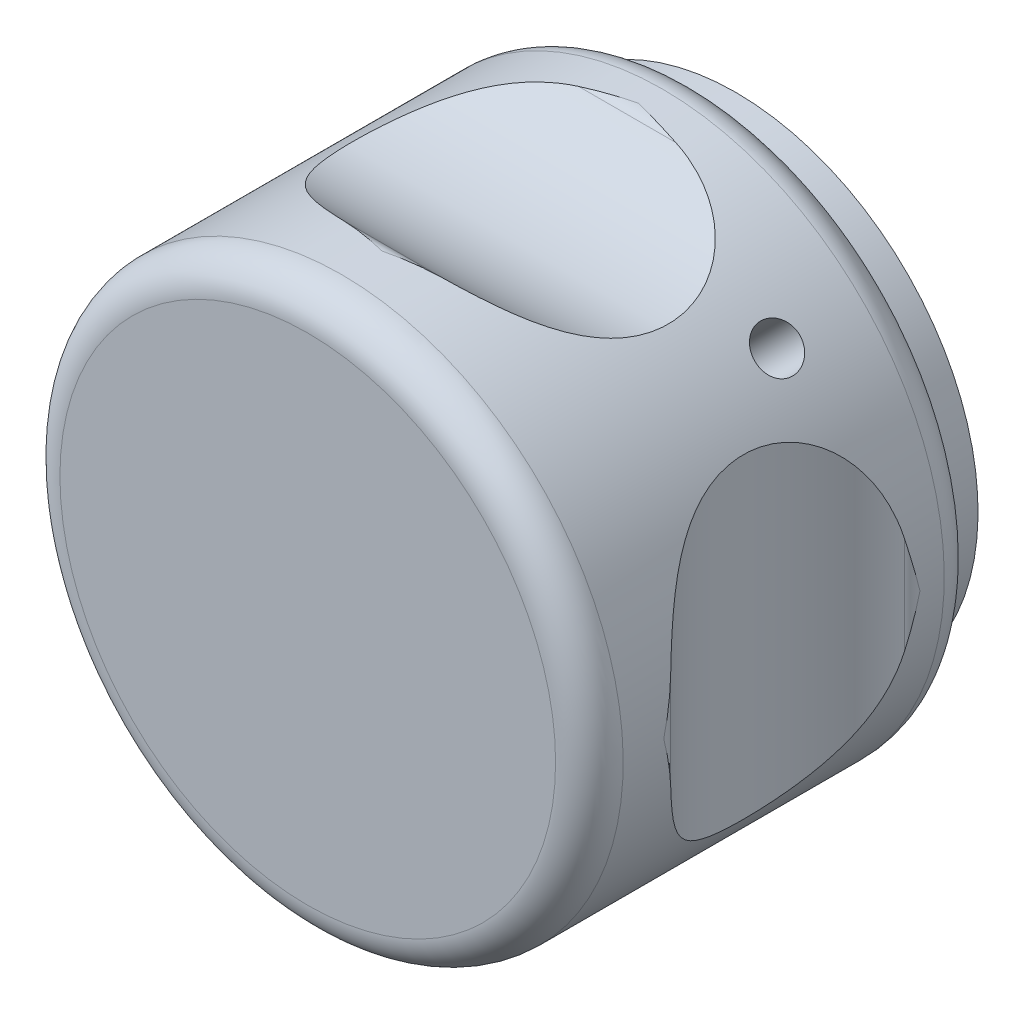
ISO-10303-21;
HEADER;
FILE_DESCRIPTION(('STEP AP214'),'2;1');
FILE_NAME('part.step','',(''),(''),'','','');
FILE_SCHEMA(('AUTOMOTIVE_DESIGN { 1 0 10303 214 1 1 1 1 }'));
ENDSEC;
DATA;
#1=APPLICATION_CONTEXT('core data for automotive mechanical design processes');
#2=APPLICATION_PROTOCOL_DEFINITION('international standard','automotive_design',2000,#1);
#3=PRODUCT_CONTEXT('',#1,'mechanical');
#4=PRODUCT('Part','Part','',(#3));
#5=PRODUCT_RELATED_PRODUCT_CATEGORY('part','',(#4));
#6=PRODUCT_DEFINITION_FORMATION('','',#4);
#7=PRODUCT_DEFINITION_CONTEXT('part definition',#1,'design');
#8=PRODUCT_DEFINITION('design','',#6,#7);
#9=PRODUCT_DEFINITION_SHAPE('','',#8);
#10=(LENGTH_UNIT() NAMED_UNIT(*) SI_UNIT(.MILLI.,.METRE.));
#11=(NAMED_UNIT(*) PLANE_ANGLE_UNIT() SI_UNIT($,.RADIAN.));
#12=(NAMED_UNIT(*) SI_UNIT($,.STERADIAN.) SOLID_ANGLE_UNIT());
#13=UNCERTAINTY_MEASURE_WITH_UNIT(LENGTH_MEASURE(1.E-05),#10,'distance_accuracy_value','');
#14=(GEOMETRIC_REPRESENTATION_CONTEXT(3) GLOBAL_UNCERTAINTY_ASSIGNED_CONTEXT((#13)) GLOBAL_UNIT_ASSIGNED_CONTEXT((#10,
#11,#12)) REPRESENTATION_CONTEXT('',''));
#15=CARTESIAN_POINT('',(0.,0.,0.));
#16=DIRECTION('',(0.,0.,1.));
#17=DIRECTION('',(1.,0.,0.));
#18=AXIS2_PLACEMENT_3D('',#15,#16,#17);
#19=CARTESIAN_POINT('',(0.,0.,22.));
#20=DIRECTION('',(0.,0.,1.));
#21=DIRECTION('',(0.,1.,0.));
#22=AXIS2_PLACEMENT_3D('',#19,#20,#21);
#23=CYLINDRICAL_SURFACE('',#22,25.);
#24=CARTESIAN_POINT('',(-24.624751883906,4.31527457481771,9.6477542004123));
#25=CARTESIAN_POINT('',(-24.5927143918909,4.49810277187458,9.68406787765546));
#26=CARTESIAN_POINT('',(-24.5587253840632,4.68007034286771,9.72292109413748));
#27=CARTESIAN_POINT('',(-24.4869681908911,5.04206634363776,9.80587913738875));
#28=CARTESIAN_POINT('',(-24.4491997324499,5.22209463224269,9.84998434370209));
#29=CARTESIAN_POINT('',(-24.3303691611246,5.75912661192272,9.99048656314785));
#30=CARTESIAN_POINT('',(-24.243821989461,6.11284956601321,10.0950254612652));
#31=CARTESIAN_POINT('',(-24.056559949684,6.81282720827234,10.3284755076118));
#32=CARTESIAN_POINT('',(-23.9557022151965,7.15896004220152,10.4576375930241));
#33=CARTESIAN_POINT('',(-23.7425153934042,7.83704065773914,10.741171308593));
#34=CARTESIAN_POINT('',(-23.6301889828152,8.16899172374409,10.8955370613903));
#35=CARTESIAN_POINT('',(-23.3958382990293,8.81784914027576,11.2321238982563));
#36=CARTESIAN_POINT('',(-23.2737576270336,9.13464808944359,11.4145135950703));
#37=CARTESIAN_POINT('',(-23.0237240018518,9.74770332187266,11.8078357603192));
#38=CARTESIAN_POINT('',(-22.895770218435,10.0439566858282,12.0187722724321));
#39=CARTESIAN_POINT('',(-22.6385929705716,10.6108677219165,12.4688633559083));
#40=CARTESIAN_POINT('',(-22.5093795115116,10.8816499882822,12.7078661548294));
#41=CARTESIAN_POINT('',(-22.2535464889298,11.395702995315,13.2150092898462));
#42=CARTESIAN_POINT('',(-22.1269257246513,11.6389867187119,13.4831357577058));
#43=CARTESIAN_POINT('',(-21.9174973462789,12.027330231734,13.9641767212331));
#44=CARTESIAN_POINT('',(-21.8327918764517,12.1801827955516,14.1700188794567));
#45=CARTESIAN_POINT('',(-21.6688929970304,12.4694300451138,14.5950068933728));
#46=CARTESIAN_POINT('',(-21.5896983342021,12.6058284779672,14.8141497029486));
#47=CARTESIAN_POINT('',(-21.4385378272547,12.8612265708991,15.2648948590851));
#48=CARTESIAN_POINT('',(-21.3665756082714,12.9802175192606,15.4965033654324));
#49=CARTESIAN_POINT('',(-21.2316029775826,13.1998355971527,15.9708041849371));
#50=CARTESIAN_POINT('',(-21.1685929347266,13.300461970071,16.2134969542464));
#51=CARTESIAN_POINT('',(-21.0528451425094,13.4829315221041,16.7092885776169));
#52=CARTESIAN_POINT('',(-21.0001458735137,13.5647045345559,16.9624222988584));
#53=CARTESIAN_POINT('',(-20.9066301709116,13.7083979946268,17.4764159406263));
#54=CARTESIAN_POINT('',(-20.8658138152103,13.7703183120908,17.7372759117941));
#55=CARTESIAN_POINT('',(-20.7971146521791,13.8738563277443,18.2646112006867));
#56=CARTESIAN_POINT('',(-20.7692289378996,13.9154785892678,18.5310852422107));
#57=CARTESIAN_POINT('',(-20.7270998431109,13.9781532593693,19.0675030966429));
#58=CARTESIAN_POINT('',(-20.712855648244,13.9992068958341,19.3374467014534));
#59=CARTESIAN_POINT('',(-20.6988847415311,14.0198537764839,19.8594376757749));
#60=CARTESIAN_POINT('',(-20.6982055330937,14.0208550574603,20.1114053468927));
#61=CARTESIAN_POINT('',(-20.708960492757,14.0049652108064,20.6145073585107));
#62=CARTESIAN_POINT('',(-20.7203940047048,13.9880750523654,20.8656417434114));
#63=CARTESIAN_POINT('',(-20.7551138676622,13.9365063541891,21.3651937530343));
#64=CARTESIAN_POINT('',(-20.7783978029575,13.9018314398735,21.6136119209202));
#65=CARTESIAN_POINT('',(-20.8362971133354,13.8148993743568,22.1060090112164));
#66=CARTESIAN_POINT('',(-20.8709125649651,13.7626421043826,22.3499879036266));
#67=CARTESIAN_POINT('',(-20.950200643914,13.6416365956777,22.8287594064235));
#68=CARTESIAN_POINT('',(-20.9947398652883,13.5731063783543,23.063629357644));
#69=CARTESIAN_POINT('',(-21.0931679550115,13.4196336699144,23.5259155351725));
#70=CARTESIAN_POINT('',(-21.1470566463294,13.3346914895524,23.7533319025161));
#71=CARTESIAN_POINT('',(-21.2630571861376,13.1489307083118,24.1993757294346));
#72=CARTESIAN_POINT('',(-21.3251682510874,13.0481136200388,24.4180040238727));
#73=CARTESIAN_POINT('',(-21.4563842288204,12.8311979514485,24.8454457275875));
#74=CARTESIAN_POINT('',(-21.5254916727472,12.7150938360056,25.0542555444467));
#75=CARTESIAN_POINT('',(-21.6730395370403,12.4620178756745,25.4715390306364));
#76=CARTESIAN_POINT('',(-21.7517772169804,12.3242796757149,25.6794425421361));
#77=CARTESIAN_POINT('',(-21.9138918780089,12.0336624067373,26.0825821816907));
#78=CARTESIAN_POINT('',(-21.9972707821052,11.880777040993,26.2778129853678));
#79=CARTESIAN_POINT('',(-22.167018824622,11.5609704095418,26.6549798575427));
#80=CARTESIAN_POINT('',(-22.2533877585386,11.3940501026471,26.8369168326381));
#81=CARTESIAN_POINT('',(-22.4275354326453,11.0473202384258,27.1871876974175));
#82=CARTESIAN_POINT('',(-22.5153137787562,10.8675142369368,27.3555253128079));
#83=CARTESIAN_POINT('',(-22.7017074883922,10.4730955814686,27.6986121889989));
#84=CARTESIAN_POINT('',(-22.8003197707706,10.2569290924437,27.8715772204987));
#85=CARTESIAN_POINT('',(-22.9956176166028,9.81125764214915,28.2005666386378));
#86=CARTESIAN_POINT('',(-23.0923030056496,9.58175148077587,28.3565894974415));
#87=CARTESIAN_POINT('',(-23.2822243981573,9.11057871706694,28.6523664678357));
#88=CARTESIAN_POINT('',(-23.3754546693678,8.86889334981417,28.7920943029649));
#89=CARTESIAN_POINT('',(-23.556866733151,8.37515512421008,29.0556078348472));
#90=CARTESIAN_POINT('',(-23.645048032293,8.12310125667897,29.1793919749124));
#91=CARTESIAN_POINT('',(-23.8227469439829,7.58705536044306,29.4221008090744));
#92=CARTESIAN_POINT('',(-23.9116780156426,7.3022236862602,29.5395994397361));
#93=CARTESIAN_POINT('',(-24.0808076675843,6.72351401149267,29.7574461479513));
#94=CARTESIAN_POINT('',(-24.1610046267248,6.42963434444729,29.8577910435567));
#95=CARTESIAN_POINT('',(-24.3112824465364,5.83565767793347,30.0418486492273));
#96=CARTESIAN_POINT('',(-24.3814049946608,5.53559254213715,30.1256304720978));
#97=CARTESIAN_POINT('',(-24.5111429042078,4.92952855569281,30.2778833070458));
#98=CARTESIAN_POINT('',(-24.5707635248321,4.62353276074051,30.3463619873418));
#99=CARTESIAN_POINT('',(-24.624771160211,4.31516457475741,30.4076254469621));
#100=B_SPLINE_CURVE_WITH_KNOTS('',3,(#24,#25,#26,#27,#28,#29,#30,#31,#32,#33,#34,#35,#36,#37,
#38,#39,#40,#41,#42,#43,#44,#45,#46,#47,#48,#49,#50,#51,#52,#53,#54,#55,#56,#57,#58,#59,#60,#61,
#62,#63,#64,#65,#66,#67,#68,#69,#70,#71,#72,#73,#74,#75,#76,#77,#78,#79,#80,#81,#82,#83,#84,#85,
#86,#87,#88,#89,#90,#91,#92,#93,#94,#95,#96,#97,#98,#99),.UNSPECIFIED.,.F.,.F.,(4,2,2,2,2,2,2,2,
2,2,2,2,2,2,2,2,2,2,2,2,2,2,2,2,2,2,2,2,2,2,2,2,2,2,2,2,2,4),(0.,0.567339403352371,
1.13471983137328,2.27018594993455,3.41791049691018,4.56536778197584,5.72002088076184,
6.87483770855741,8.02367475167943,9.17196711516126,9.98122169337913,10.7902916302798,
11.5997650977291,12.4092719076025,13.2217445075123,14.034222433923,14.8465176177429,
15.6587643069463,16.4137598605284,17.1687145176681,17.9235153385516,18.6783212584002,
19.4235344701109,20.1687335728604,20.9138617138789,21.6592603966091,22.443014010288,
23.2270948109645,24.0111220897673,24.7949338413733,25.675736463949,26.5566184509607,
27.4389018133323,28.3212712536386,29.2825997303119,30.2441063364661,31.2015120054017,
32.1584368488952),.UNSPECIFIED.);
#101=CARTESIAN_POINT('',(-24.624751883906,4.3152745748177,9.64775420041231));
#102=VERTEX_POINT('',#101);
#103=CARTESIAN_POINT('',(-24.624771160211,4.31516457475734,30.407625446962));
#104=VERTEX_POINT('',#103);
#105=EDGE_CURVE('E267',#102,#104,#100,.T.);
#106=ORIENTED_EDGE('',*,*,#105,.T.);
#107=CARTESIAN_POINT('',(-24.624771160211,4.31516457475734,30.407625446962));
#108=CARTESIAN_POINT('',(-24.6672386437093,4.07281069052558,30.4557679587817));
#109=CARTESIAN_POINT('',(-24.7060578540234,3.83025348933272,30.5059690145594));
#110=CARTESIAN_POINT('',(-24.7764467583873,3.34482402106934,30.6096936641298));
#111=CARTESIAN_POINT('',(-24.8080172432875,3.10195179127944,30.6632168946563));
#112=CARTESIAN_POINT('',(-24.8919057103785,2.3732082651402,30.8275299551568));
#113=CARTESIAN_POINT('',(-24.9334508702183,1.88692297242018,30.942122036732));
#114=CARTESIAN_POINT('',(-24.9863552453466,0.943954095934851,31.1688012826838));
#115=CARTESIAN_POINT('',(-24.9994202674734,0.487297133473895,31.2806060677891));
#116=CARTESIAN_POINT('',(-24.9999937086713,0.0204765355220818,31.3949456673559));
#117=CARTESIAN_POINT('',(-24.9999999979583,0.0102382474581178,31.3974533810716));
#118=CARTESIAN_POINT('',(-25.0000000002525,0.,31.3999610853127));
#119=B_SPLINE_CURVE_WITH_KNOTS('',3,(#107,#108,#109,#110,#111,#112,#113,#114,#115,#116,#117,
#118),.UNSPECIFIED.,.F.,.F.,(4,2,2,2,2,4),(0.,0.752056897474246,1.50403170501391,
3.00709070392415,4.41732146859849,4.44894425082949),.UNSPECIFIED.);
#120=CARTESIAN_POINT('',(-25.,0.,31.3999610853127));
#121=VERTEX_POINT('',#120);
#122=EDGE_CURVE('E803',#104,#121,#119,.T.);
#123=ORIENTED_EDGE('',*,*,#122,.T.);
#124=CARTESIAN_POINT('',(-24.624771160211,-4.31516457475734,30.407625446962));
#125=CARTESIAN_POINT('',(-24.6672386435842,-4.07281069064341,30.4557679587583));
#126=CARTESIAN_POINT('',(-24.7060578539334,-3.83025348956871,30.5059690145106));
#127=CARTESIAN_POINT('',(-24.7764467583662,-3.34482402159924,30.6096936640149));
#128=CARTESIAN_POINT('',(-24.808017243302,-3.10195179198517,30.6632168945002));
#129=CARTESIAN_POINT('',(-24.8919057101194,-2.37320826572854,30.8275299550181));
#130=CARTESIAN_POINT('',(-24.9334508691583,-1.8869229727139,30.9421220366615));
#131=CARTESIAN_POINT('',(-24.9863552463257,-0.943954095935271,31.1688012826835));
#132=CARTESIAN_POINT('',(-24.9994202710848,-0.487297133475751,31.2806060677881));
#133=CARTESIAN_POINT('',(-24.9999937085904,-0.0204765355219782,31.3949456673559));
#134=CARTESIAN_POINT('',(-24.9999999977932,-0.0102382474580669,31.3974533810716));
#135=CARTESIAN_POINT('',(-25.,0.,31.3999610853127));
#136=B_SPLINE_CURVE_WITH_KNOTS('',3,(#124,#125,#126,#127,#128,#129,#130,#131,#132,#133,#134,
#135),.UNSPECIFIED.,.F.,.F.,(4,2,2,2,2,4),(0.,0.752056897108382,1.50403170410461,
3.00709070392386,4.41732146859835,4.44894425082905),.UNSPECIFIED.);
#137=CARTESIAN_POINT('',(-24.624771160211,-4.31516457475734,30.407625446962));
#138=VERTEX_POINT('',#137);
#139=EDGE_CURVE('E736',#138,#121,#136,.T.);
#140=ORIENTED_EDGE('',*,*,#139,.F.);
#141=CARTESIAN_POINT('',(-24.624751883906,-4.31527457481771,9.64775420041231));
#142=CARTESIAN_POINT('',(-24.5927143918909,-4.49810277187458,9.68406787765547));
#143=CARTESIAN_POINT('',(-24.5587253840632,-4.68007034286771,9.72292109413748));
#144=CARTESIAN_POINT('',(-24.4869681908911,-5.04206634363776,9.80587913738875));
#145=CARTESIAN_POINT('',(-24.4491997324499,-5.22209463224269,9.84998434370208));
#146=CARTESIAN_POINT('',(-24.3303691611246,-5.75912661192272,9.99048656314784));
#147=CARTESIAN_POINT('',(-24.243821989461,-6.11284956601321,10.0950254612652));
#148=CARTESIAN_POINT('',(-24.056559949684,-6.81282720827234,10.3284755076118));
#149=CARTESIAN_POINT('',(-23.9557022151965,-7.15896004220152,10.4576375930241));
#150=CARTESIAN_POINT('',(-23.7425153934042,-7.83704065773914,10.741171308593));
#151=CARTESIAN_POINT('',(-23.6301889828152,-8.16899172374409,10.8955370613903));
#152=CARTESIAN_POINT('',(-23.3958382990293,-8.81784914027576,11.2321238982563));
#153=CARTESIAN_POINT('',(-23.2737576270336,-9.13464808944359,11.4145135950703));
#154=CARTESIAN_POINT('',(-23.0237240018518,-9.74770332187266,11.8078357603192));
#155=CARTESIAN_POINT('',(-22.895770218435,-10.0439566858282,12.0187722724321));
#156=CARTESIAN_POINT('',(-22.6385929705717,-10.6108677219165,12.4688633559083));
#157=CARTESIAN_POINT('',(-22.5093795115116,-10.8816499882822,12.7078661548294));
#158=CARTESIAN_POINT('',(-22.2535464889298,-11.395702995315,13.2150092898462));
#159=CARTESIAN_POINT('',(-22.1269257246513,-11.638986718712,13.4831357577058));
#160=CARTESIAN_POINT('',(-21.9174973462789,-12.027330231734,13.9641767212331));
#161=CARTESIAN_POINT('',(-21.8327918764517,-12.1801827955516,14.1700188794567));
#162=CARTESIAN_POINT('',(-21.6688929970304,-12.4694300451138,14.5950068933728));
#163=CARTESIAN_POINT('',(-21.5896983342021,-12.6058284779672,14.8141497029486));
#164=CARTESIAN_POINT('',(-21.4385378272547,-12.8612265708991,15.2648948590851));
#165=CARTESIAN_POINT('',(-21.3665756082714,-12.9802175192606,15.4965033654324));
#166=CARTESIAN_POINT('',(-21.2316029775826,-13.1998355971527,15.9708041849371));
#167=CARTESIAN_POINT('',(-21.1685929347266,-13.300461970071,16.2134969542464));
#168=CARTESIAN_POINT('',(-21.0528451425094,-13.4829315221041,16.7092885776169));
#169=CARTESIAN_POINT('',(-21.0001458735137,-13.5647045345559,16.9624222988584));
#170=CARTESIAN_POINT('',(-20.9066301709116,-13.7083979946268,17.4764159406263));
#171=CARTESIAN_POINT('',(-20.8658138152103,-13.7703183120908,17.7372759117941));
#172=CARTESIAN_POINT('',(-20.7971146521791,-13.8738563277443,18.2646112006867));
#173=CARTESIAN_POINT('',(-20.7692289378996,-13.9154785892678,18.5310852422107));
#174=CARTESIAN_POINT('',(-20.7270998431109,-13.9781532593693,19.0675030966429));
#175=CARTESIAN_POINT('',(-20.7128556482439,-13.9992068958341,19.3374467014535));
#176=CARTESIAN_POINT('',(-20.6988847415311,-14.0198537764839,19.859437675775));
#177=CARTESIAN_POINT('',(-20.6982055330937,-14.0208550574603,20.1114053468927));
#178=CARTESIAN_POINT('',(-20.708960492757,-14.0049652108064,20.6145073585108));
#179=CARTESIAN_POINT('',(-20.7203940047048,-13.9880750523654,20.8656417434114));
#180=CARTESIAN_POINT('',(-20.7551138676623,-13.9365063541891,21.3651937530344));
#181=CARTESIAN_POINT('',(-20.7783978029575,-13.9018314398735,21.6136119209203));
#182=CARTESIAN_POINT('',(-20.8362971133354,-13.8148993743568,22.1060090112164));
#183=CARTESIAN_POINT('',(-20.8709125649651,-13.7626421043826,22.3499879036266));
#184=CARTESIAN_POINT('',(-20.950200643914,-13.6416365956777,22.8287594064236));
#185=CARTESIAN_POINT('',(-20.9947398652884,-13.5731063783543,23.063629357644));
#186=CARTESIAN_POINT('',(-21.0931679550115,-13.4196336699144,23.5259155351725));
#187=CARTESIAN_POINT('',(-21.1470566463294,-13.3346914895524,23.7533319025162));
#188=CARTESIAN_POINT('',(-21.2630571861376,-13.1489307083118,24.1993757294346));
#189=CARTESIAN_POINT('',(-21.3251682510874,-13.0481136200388,24.4180040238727));
#190=CARTESIAN_POINT('',(-21.4563842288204,-12.8311979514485,24.8454457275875));
#191=CARTESIAN_POINT('',(-21.5254916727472,-12.7150938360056,25.0542555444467));
#192=CARTESIAN_POINT('',(-21.6730395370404,-12.4620178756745,25.4715390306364));
#193=CARTESIAN_POINT('',(-21.7517772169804,-12.3242796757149,25.6794425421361));
#194=CARTESIAN_POINT('',(-21.9138918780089,-12.0336624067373,26.0825821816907));
#195=CARTESIAN_POINT('',(-21.9972707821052,-11.880777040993,26.2778129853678));
#196=CARTESIAN_POINT('',(-22.167018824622,-11.5609704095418,26.6549798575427));
#197=CARTESIAN_POINT('',(-22.2533877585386,-11.3940501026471,26.8369168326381));
#198=CARTESIAN_POINT('',(-22.4275354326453,-11.0473202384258,27.1871876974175));
#199=CARTESIAN_POINT('',(-22.5153137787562,-10.8675142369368,27.3555253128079));
#200=CARTESIAN_POINT('',(-22.7017074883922,-10.4730955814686,27.6986121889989));
#201=CARTESIAN_POINT('',(-22.8003197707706,-10.2569290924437,27.8715772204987));
#202=CARTESIAN_POINT('',(-22.9956176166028,-9.81125764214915,28.2005666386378));
#203=CARTESIAN_POINT('',(-23.0923030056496,-9.58175148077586,28.3565894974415));
#204=CARTESIAN_POINT('',(-23.2822243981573,-9.11057871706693,28.6523664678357));
#205=CARTESIAN_POINT('',(-23.3754546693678,-8.86889334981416,28.7920943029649));
#206=CARTESIAN_POINT('',(-23.556866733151,-8.37515512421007,29.0556078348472));
#207=CARTESIAN_POINT('',(-23.645048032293,-8.12310125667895,29.1793919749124));
#208=CARTESIAN_POINT('',(-23.8227469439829,-7.58705536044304,29.4221008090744));
#209=CARTESIAN_POINT('',(-23.9116780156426,-7.30222368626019,29.5395994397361));
#210=CARTESIAN_POINT('',(-24.0808076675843,-6.72351401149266,29.7574461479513));
#211=CARTESIAN_POINT('',(-24.1610046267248,-6.42963434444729,29.8577910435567));
#212=CARTESIAN_POINT('',(-24.3112824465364,-5.83565767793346,30.0418486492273));
#213=CARTESIAN_POINT('',(-24.3814049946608,-5.53559254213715,30.1256304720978));
#214=CARTESIAN_POINT('',(-24.5111429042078,-4.92952855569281,30.2778833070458));
#215=CARTESIAN_POINT('',(-24.5707635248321,-4.62353276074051,30.3463619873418));
#216=CARTESIAN_POINT('',(-24.624771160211,-4.31516457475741,30.4076254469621));
#217=B_SPLINE_CURVE_WITH_KNOTS('',3,(#141,#142,#143,#144,#145,#146,#147,#148,#149,#150,#151,
#152,#153,#154,#155,#156,#157,#158,#159,#160,#161,#162,#163,#164,#165,#166,#167,#168,#169,#170,
#171,#172,#173,#174,#175,#176,#177,#178,#179,#180,#181,#182,#183,#184,#185,#186,#187,#188,#189,
#190,#191,#192,#193,#194,#195,#196,#197,#198,#199,#200,#201,#202,#203,#204,#205,#206,#207,#208,
#209,#210,#211,#212,#213,#214,#215,#216),.UNSPECIFIED.,.F.,.F.,(4,2,2,2,2,2,2,2,2,2,2,2,2,2,2,2,
2,2,2,2,2,2,2,2,2,2,2,2,2,2,2,2,2,2,2,2,2,4),(0.,0.567339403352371,1.13471983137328,
2.27018594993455,3.41791049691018,4.56536778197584,5.72002088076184,6.87483770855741,
8.02367475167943,9.17196711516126,9.98122169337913,10.7902916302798,11.5997650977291,
12.4092719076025,13.2217445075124,14.034222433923,14.8465176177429,15.6587643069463,
16.4137598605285,17.1687145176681,17.9235153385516,18.6783212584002,19.4235344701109,
20.1687335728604,20.9138617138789,21.6592603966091,22.443014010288,23.2270948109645,
24.0111220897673,24.7949338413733,25.675736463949,26.5566184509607,27.4389018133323,
28.3212712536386,29.2825997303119,30.2441063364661,31.2015120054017,32.1584368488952),.UNSPECIFIED.);
#218=CARTESIAN_POINT('',(-24.624751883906,-4.3152745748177,9.64775420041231));
#219=VERTEX_POINT('',#218);
#220=EDGE_CURVE('E743',#219,#138,#217,.T.);
#221=ORIENTED_EDGE('',*,*,#220,.F.);
#222=CARTESIAN_POINT('',(-24.624751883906,-4.31527457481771,9.6477542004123));
#223=CARTESIAN_POINT('',(-24.6672272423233,-4.07288210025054,9.59959869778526));
#224=CARTESIAN_POINT('',(-24.7060531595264,-3.83028626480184,9.54938409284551));
#225=CARTESIAN_POINT('',(-24.7764531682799,-3.34477941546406,9.44563162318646));
#226=CARTESIAN_POINT('',(-24.8080280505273,-3.10186843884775,9.39209412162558));
#227=CARTESIAN_POINT('',(-24.8919262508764,-2.37300876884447,9.22773783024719));
#228=CARTESIAN_POINT('',(-24.9334733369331,-1.88664590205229,9.11311630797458));
#229=CARTESIAN_POINT('',(-24.9863620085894,-0.943717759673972,8.88642458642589));
#230=CARTESIAN_POINT('',(-24.9994204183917,-0.48717924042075,8.77463857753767));
#231=CARTESIAN_POINT('',(-24.9999937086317,-0.020476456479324,8.66031994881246));
#232=CARTESIAN_POINT('',(-24.9999999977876,-0.010238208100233,8.65781207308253));
#233=CARTESIAN_POINT('',(-25.0000000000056,0.,8.65530420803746));
#234=B_SPLINE_CURVE_WITH_KNOTS('',3,(#222,#223,#224,#225,#226,#227,#228,#229,#230,#231,#232,
#233),.UNSPECIFIED.,.F.,.F.,(4,2,2,2,2,4),(0.,0.752180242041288,1.50427842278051,
3.00758331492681,4.41745582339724,4.44907860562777),.UNSPECIFIED.);
#235=CARTESIAN_POINT('',(-25.0000000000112,0.,8.65530420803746));
#236=VERTEX_POINT('',#235);
#237=EDGE_CURVE('E787',#236,#219,#234,.F.);
#238=ORIENTED_EDGE('',*,*,#237,.F.);
#239=CARTESIAN_POINT('',(-24.624751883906,4.31527457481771,9.6477542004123));
#240=CARTESIAN_POINT('',(-24.6672272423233,4.07288210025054,9.59959869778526));
#241=CARTESIAN_POINT('',(-24.7060531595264,3.83028626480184,9.54938409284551));
#242=CARTESIAN_POINT('',(-24.7764531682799,3.34477941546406,9.44563162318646));
#243=CARTESIAN_POINT('',(-24.8080280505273,3.10186843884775,9.39209412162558));
#244=CARTESIAN_POINT('',(-24.8919262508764,2.37300876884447,9.22773783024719));
#245=CARTESIAN_POINT('',(-24.9334733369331,1.88664590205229,9.11311630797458));
#246=CARTESIAN_POINT('',(-24.9863620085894,0.943717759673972,8.88642458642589));
#247=CARTESIAN_POINT('',(-24.9994204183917,0.48717924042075,8.77463857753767));
#248=CARTESIAN_POINT('',(-24.9999937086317,0.020476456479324,8.66031994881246));
#249=CARTESIAN_POINT('',(-24.9999999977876,0.010238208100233,8.65781207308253));
#250=CARTESIAN_POINT('',(-25.0000000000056,0.,8.65530420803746));
#251=B_SPLINE_CURVE_WITH_KNOTS('',3,(#239,#240,#241,#242,#243,#244,#245,#246,#247,#248,#249,
#250),.UNSPECIFIED.,.F.,.F.,(4,2,2,2,2,4),(0.,0.752180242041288,1.50427842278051,
3.00758331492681,4.41745582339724,4.44907860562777),.UNSPECIFIED.);
#252=EDGE_CURVE('E821',#236,#102,#251,.F.);
#253=ORIENTED_EDGE('',*,*,#252,.T.);
#254=EDGE_LOOP('',(#106,#123,#140,#221,#238,#253));
#255=FACE_BOUND('',#254,.T.);
#256=CARTESIAN_POINT('',(-4.31516457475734,24.624771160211,30.407625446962));
#257=CARTESIAN_POINT('',(-4.49799412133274,24.5927342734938,30.3713125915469));
#258=CARTESIAN_POINT('',(-4.67996305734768,24.5587458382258,30.3324601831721));
#259=CARTESIAN_POINT('',(-5.04196181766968,24.486989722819,30.2495037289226));
#260=CARTESIAN_POINT('',(-5.22199150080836,24.4492217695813,30.2053993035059));
#261=CARTESIAN_POINT('',(-5.75902770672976,24.3303926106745,30.0648993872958));
#262=CARTESIAN_POINT('',(-6.11275353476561,24.2438462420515,29.9603619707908));
#263=CARTESIAN_POINT('',(-6.81273707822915,24.0565855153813,29.7269147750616));
#264=CARTESIAN_POINT('',(-7.15887293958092,23.9557282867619,29.5977540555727));
#265=CARTESIAN_POINT('',(-7.83695968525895,23.7425421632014,29.3142229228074));
#266=CARTESIAN_POINT('',(-8.16891385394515,23.6302159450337,29.159858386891));
#267=CARTESIAN_POINT('',(-8.81777754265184,23.395865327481,28.82327380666));
#268=CARTESIAN_POINT('',(-9.13457966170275,23.2737845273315,28.640885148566));
#269=CARTESIAN_POINT('',(-9.7476412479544,23.0237503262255,28.2475648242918));
#270=CARTESIAN_POINT('',(-10.0438977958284,22.8957960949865,28.0366291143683));
#271=CARTESIAN_POINT('',(-10.6108151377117,22.6386176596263,27.5865393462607));
#272=CARTESIAN_POINT('',(-10.8816005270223,22.5094034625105,27.3475370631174));
#273=CARTESIAN_POINT('',(-11.3956596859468,22.2535687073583,26.8403946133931));
#274=CARTESIAN_POINT('',(-11.6389464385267,22.1269469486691,26.5722683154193));
#275=CARTESIAN_POINT('',(-12.0272943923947,21.9175170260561,26.0912280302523));
#276=CARTESIAN_POINT('',(-12.1801484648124,21.8328110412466,25.8853865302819));
#277=CARTESIAN_POINT('',(-12.4693987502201,21.6689110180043,25.4603997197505));
#278=CARTESIAN_POINT('',(-12.6057987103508,21.5897157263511,25.2412574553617));
#279=CARTESIAN_POINT('',(-12.8611998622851,21.4385538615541,24.7905132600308));
#280=CARTESIAN_POINT('',(-12.9801923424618,21.3665909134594,24.5589051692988));
#281=CARTESIAN_POINT('',(-13.1998134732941,21.2316167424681,24.0846050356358));
#282=CARTESIAN_POINT('',(-13.3004413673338,21.1686058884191,23.8419125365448));
#283=CARTESIAN_POINT('',(-13.482913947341,21.052856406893,23.3461212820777));
#284=CARTESIAN_POINT('',(-13.5646884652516,21.0001562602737,23.0929876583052));
#285=CARTESIAN_POINT('',(-13.7083848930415,20.9066387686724,22.5789940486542));
#286=CARTESIAN_POINT('',(-13.7703066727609,20.8658215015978,22.3181340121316));
#287=CARTESIAN_POINT('',(-13.8738475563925,20.7971205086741,21.7907984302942));
#288=CARTESIAN_POINT('',(-13.9154712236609,20.7692338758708,21.5243241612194));
#289=CARTESIAN_POINT('',(-13.9781486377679,20.7271029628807,20.987905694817));
#290=CARTESIAN_POINT('',(-13.9992036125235,20.7128578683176,20.7179617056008));
#291=CARTESIAN_POINT('',(-14.0198529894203,20.6988852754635,20.1959701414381));
#292=CARTESIAN_POINT('',(-14.02085545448,20.6982052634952,19.9440022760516));
#293=CARTESIAN_POINT('',(-14.00496794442,20.708958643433,19.4408997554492));
#294=CARTESIAN_POINT('',(-13.9880789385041,20.7203913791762,19.1897650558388));
#295=CARTESIAN_POINT('',(-13.936512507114,20.7551097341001,18.6902123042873));
#296=CARTESIAN_POINT('',(-13.9018387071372,20.7783929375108,18.4417937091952));
#297=CARTESIAN_POINT('',(-13.8149088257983,20.8362908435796,17.9493956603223));
#298=CARTESIAN_POINT('',(-13.7626526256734,20.8709056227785,17.7054162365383));
#299=CARTESIAN_POINT('',(-13.6416492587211,20.9501923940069,17.2266438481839));
#300=CARTESIAN_POINT('',(-13.573120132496,20.9947309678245,16.9917735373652));
#301=CARTESIAN_POINT('',(-13.4196495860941,21.0931578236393,16.5294865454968));
#302=CARTESIAN_POINT('',(-13.3347084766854,21.147045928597,16.3020697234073));
#303=CARTESIAN_POINT('',(-13.1489498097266,21.2630453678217,15.8560249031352));
#304=CARTESIAN_POINT('',(-13.0481337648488,21.3251559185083,15.6373960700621));
#305=CARTESIAN_POINT('',(-12.8312201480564,21.4563709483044,15.209953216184));
#306=CARTESIAN_POINT('',(-12.7151170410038,21.525477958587,15.0011427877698));
#307=CARTESIAN_POINT('',(-12.462043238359,21.6730249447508,14.5838582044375));
#308=CARTESIAN_POINT('',(-12.3243062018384,21.7517621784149,14.3759541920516));
#309=CARTESIAN_POINT('',(-12.0336912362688,21.9138760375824,13.9728134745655));
#310=CARTESIAN_POINT('',(-11.8808070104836,21.9972545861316,13.7775820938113));
#311=CARTESIAN_POINT('',(-11.5610026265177,22.1670020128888,13.4004140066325));
#312=CARTESIAN_POINT('',(-11.3940834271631,22.2533706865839,13.2184763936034));
#313=CARTESIAN_POINT('',(-11.0473557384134,22.4275179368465,12.8682042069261));
#314=CARTESIAN_POINT('',(-10.867550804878,22.515296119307,12.6998659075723));
#315=CARTESIAN_POINT('',(-10.4731345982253,22.7016894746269,12.3567777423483));
#316=CARTESIAN_POINT('',(-10.25696950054,22.8003015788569,12.183812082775));
#317=CARTESIAN_POINT('',(-9.81130079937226,22.99559918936,11.8548213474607));
#318=CARTESIAN_POINT('',(-9.58179599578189,23.0922845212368,11.6987977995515));
#319=CARTESIAN_POINT('',(-9.11062591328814,23.2822059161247,11.4030194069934));
#320=CARTESIAN_POINT('',(-8.86894186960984,23.3754362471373,11.2632908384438));
#321=CARTESIAN_POINT('',(-8.37520624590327,23.5568485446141,10.9997758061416));
#322=CARTESIAN_POINT('',(-8.12315365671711,23.6450300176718,10.8759908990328));
#323=CARTESIAN_POINT('',(-7.58711350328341,23.8227283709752,10.6332818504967));
#324=CARTESIAN_POINT('',(-7.30228640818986,23.9116588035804,10.5157835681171));
#325=CARTESIAN_POINT('',(-6.72358601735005,24.0807875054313,10.2979371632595));
#326=CARTESIAN_POINT('',(-6.42971105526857,24.1609841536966,10.19759222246));
#327=CARTESIAN_POINT('',(-5.83574384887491,24.3112617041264,10.0135341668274));
#328=CARTESIAN_POINT('',(-5.53568346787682,24.381384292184,9.92975194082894));
#329=CARTESIAN_POINT('',(-4.92962901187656,24.5111226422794,9.77749796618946));
#330=CARTESIAN_POINT('',(-4.62363799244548,24.5707436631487,9.70901854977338));
#331=CARTESIAN_POINT('',(-4.31527457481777,24.624751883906,9.64775420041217));
#332=B_SPLINE_CURVE_WITH_KNOTS('',3,(#256,#257,#258,#259,#260,#261,#262,#263,#264,#265,#266,
#267,#268,#269,#270,#271,#272,#273,#274,#275,#276,#277,#278,#279,#280,#281,#282,#283,#284,#285,
#286,#287,#288,#289,#290,#291,#292,#293,#294,#295,#296,#297,#298,#299,#300,#301,#302,#303,#304,
#305,#306,#307,#308,#309,#310,#311,#312,#313,#314,#315,#316,#317,#318,#319,#320,#321,#322,#323,
#324,#325,#326,#327,#328,#329,#330,#331),.UNSPECIFIED.,.F.,.F.,(4,2,2,2,2,2,2,2,2,2,2,2,2,2,2,2,
2,2,2,2,2,2,2,2,2,2,2,2,2,2,2,2,2,2,2,2,2,4),(0.,0.567342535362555,1.13472609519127,
2.27019847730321,3.41792944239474,4.56539314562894,5.72005269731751,6.87487598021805,
8.02371940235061,9.17201813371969,9.98127425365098,10.7903457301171,11.5998207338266,
12.409329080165,13.2218032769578,14.0342828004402,14.8465795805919,15.6588278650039,
16.4138240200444,17.1687792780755,17.9235806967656,18.6783872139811,19.4236001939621,
20.1687990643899,20.9139269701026,21.6593254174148,22.4430779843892,23.2271577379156,
24.0111839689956,24.794994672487,25.675795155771,26.5566750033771,27.4389562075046,
28.3213234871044,29.2826388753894,30.2441323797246,31.2015250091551,32.1584368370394),.UNSPECIFIED.);
#333=CARTESIAN_POINT('',(-4.31516457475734,24.624771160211,30.407625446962));
#334=VERTEX_POINT('',#333);
#335=CARTESIAN_POINT('',(-4.31527457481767,24.624751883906,9.6477542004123));
#336=VERTEX_POINT('',#335);
#337=EDGE_CURVE('E272',#334,#336,#332,.T.);
#338=ORIENTED_EDGE('',*,*,#337,.T.);
#339=CARTESIAN_POINT('',(-4.31527457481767,24.624751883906,9.6477542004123));
#340=CARTESIAN_POINT('',(-4.07288210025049,24.6672272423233,9.5995986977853));
#341=CARTESIAN_POINT('',(-3.83028626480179,24.7060531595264,9.54938409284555));
#342=CARTESIAN_POINT('',(-3.344779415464,24.7764531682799,9.4456316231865));
#343=CARTESIAN_POINT('',(-3.10186843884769,24.8080280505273,9.3920941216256));
#344=CARTESIAN_POINT('',(-2.3730087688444,24.8919262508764,9.22773783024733));
#345=CARTESIAN_POINT('',(-1.88664590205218,24.9334733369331,9.11311630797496));
#346=CARTESIAN_POINT('',(-0.943717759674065,24.9863620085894,8.88642458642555));
#347=CARTESIAN_POINT('',(-0.487179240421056,24.9994204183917,8.77463857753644));
#348=CARTESIAN_POINT('',(-0.0204764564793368,24.9999937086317,8.66031994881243));
#349=CARTESIAN_POINT('',(-0.0102382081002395,24.9999999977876,8.65781207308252));
#350=CARTESIAN_POINT('',(0.,25.0000000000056,8.65530420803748));
#351=B_SPLINE_CURVE_WITH_KNOTS('',3,(#339,#340,#341,#342,#343,#344,#345,#346,#347,#348,#349,
#350),.UNSPECIFIED.,.F.,.F.,(4,2,2,2,2,4),(0.,0.752180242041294,1.50427842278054,
3.00758331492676,4.4174558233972,4.44907860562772),.UNSPECIFIED.);
#352=CARTESIAN_POINT('',(0.,25.,8.65530420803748));
#353=VERTEX_POINT('',#352);
#354=EDGE_CURVE('E771',#336,#353,#351,.T.);
#355=ORIENTED_EDGE('',*,*,#354,.T.);
#356=CARTESIAN_POINT('',(4.31527457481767,24.624751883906,9.6477542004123));
#357=CARTESIAN_POINT('',(4.0728821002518,24.6672272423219,9.59959869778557));
#358=CARTESIAN_POINT('',(3.83028626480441,24.7060531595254,9.5493840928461));
#359=CARTESIAN_POINT('',(3.34477941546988,24.7764531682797,9.44563162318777));
#360=CARTESIAN_POINT('',(3.10186843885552,24.8080280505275,9.39209412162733));
#361=CARTESIAN_POINT('',(2.37300876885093,24.8919262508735,9.22773783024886));
#362=CARTESIAN_POINT('',(1.88664590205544,24.9334733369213,9.11311630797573));
#363=CARTESIAN_POINT('',(0.943717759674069,24.9863620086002,8.88642458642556));
#364=CARTESIAN_POINT('',(0.487179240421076,24.9994204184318,8.77463857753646));
#365=CARTESIAN_POINT('',(0.0204764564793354,24.9999937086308,8.66031994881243));
#366=CARTESIAN_POINT('',(0.0102382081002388,24.9999999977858,8.65781207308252));
#367=CARTESIAN_POINT('',(0.,25.0000000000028,8.65530420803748));
#368=B_SPLINE_CURVE_WITH_KNOTS('',3,(#356,#357,#358,#359,#360,#361,#362,#363,#364,#365,#366,
#367),.UNSPECIFIED.,.F.,.F.,(4,2,2,2,2,4),(0.,0.752180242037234,1.50427842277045,
3.00758331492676,4.4174558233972,4.44907860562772),.UNSPECIFIED.);
#369=CARTESIAN_POINT('',(4.31527457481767,24.624751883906,9.6477542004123));
#370=VERTEX_POINT('',#369);
#371=EDGE_CURVE('E191',#370,#353,#368,.T.);
#372=ORIENTED_EDGE('',*,*,#371,.F.);
#373=CARTESIAN_POINT('',(4.31516457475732,24.624771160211,30.407625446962));
#374=CARTESIAN_POINT('',(4.49799412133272,24.5927342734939,30.3713125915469));
#375=CARTESIAN_POINT('',(4.67996305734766,24.5587458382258,30.3324601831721));
#376=CARTESIAN_POINT('',(5.04196181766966,24.486989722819,30.2495037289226));
#377=CARTESIAN_POINT('',(5.22199150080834,24.4492217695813,30.2053993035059));
#378=CARTESIAN_POINT('',(5.75902770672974,24.3303926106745,30.0648993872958));
#379=CARTESIAN_POINT('',(6.11275353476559,24.2438462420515,29.9603619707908));
#380=CARTESIAN_POINT('',(6.81273707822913,24.0565855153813,29.7269147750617));
#381=CARTESIAN_POINT('',(7.1588729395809,23.9557282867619,29.5977540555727));
#382=CARTESIAN_POINT('',(7.83695968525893,23.7425421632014,29.3142229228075));
#383=CARTESIAN_POINT('',(8.16891385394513,23.6302159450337,29.159858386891));
#384=CARTESIAN_POINT('',(8.81777754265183,23.395865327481,28.82327380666));
#385=CARTESIAN_POINT('',(9.13457966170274,23.2737845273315,28.640885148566));
#386=CARTESIAN_POINT('',(9.74764124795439,23.0237503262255,28.2475648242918));
#387=CARTESIAN_POINT('',(10.0438977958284,22.8957960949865,28.0366291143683));
#388=CARTESIAN_POINT('',(10.6108151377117,22.6386176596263,27.5865393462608));
#389=CARTESIAN_POINT('',(10.8816005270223,22.5094034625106,27.3475370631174));
#390=CARTESIAN_POINT('',(11.3956596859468,22.2535687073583,26.8403946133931));
#391=CARTESIAN_POINT('',(11.6389464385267,22.1269469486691,26.5722683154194));
#392=CARTESIAN_POINT('',(12.0272943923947,21.9175170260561,26.0912280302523));
#393=CARTESIAN_POINT('',(12.1801484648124,21.8328110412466,25.885386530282));
#394=CARTESIAN_POINT('',(12.46939875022,21.6689110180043,25.4603997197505));
#395=CARTESIAN_POINT('',(12.6057987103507,21.5897157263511,25.2412574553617));
#396=CARTESIAN_POINT('',(12.8611998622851,21.4385538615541,24.7905132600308));
#397=CARTESIAN_POINT('',(12.9801923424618,21.3665909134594,24.5589051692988));
#398=CARTESIAN_POINT('',(13.1998134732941,21.2316167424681,24.0846050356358));
#399=CARTESIAN_POINT('',(13.3004413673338,21.1686058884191,23.8419125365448));
#400=CARTESIAN_POINT('',(13.482913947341,21.052856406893,23.3461212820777));
#401=CARTESIAN_POINT('',(13.5646884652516,21.0001562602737,23.0929876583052));
#402=CARTESIAN_POINT('',(13.7083848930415,20.9066387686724,22.5789940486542));
#403=CARTESIAN_POINT('',(13.7703066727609,20.8658215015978,22.3181340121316));
#404=CARTESIAN_POINT('',(13.8738475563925,20.7971205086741,21.7907984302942));
#405=CARTESIAN_POINT('',(13.9154712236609,20.7692338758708,21.5243241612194));
#406=CARTESIAN_POINT('',(13.9781486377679,20.7271029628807,20.987905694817));
#407=CARTESIAN_POINT('',(13.9992036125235,20.7128578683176,20.7179617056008));
#408=CARTESIAN_POINT('',(14.0198529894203,20.6988852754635,20.1959701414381));
#409=CARTESIAN_POINT('',(14.02085545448,20.6982052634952,19.9440022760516));
#410=CARTESIAN_POINT('',(14.00496794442,20.708958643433,19.4408997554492));
#411=CARTESIAN_POINT('',(13.9880789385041,20.7203913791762,19.1897650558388));
#412=CARTESIAN_POINT('',(13.936512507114,20.7551097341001,18.6902123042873));
#413=CARTESIAN_POINT('',(13.9018387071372,20.7783929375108,18.4417937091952));
#414=CARTESIAN_POINT('',(13.8149088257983,20.8362908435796,17.9493956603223));
#415=CARTESIAN_POINT('',(13.7626526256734,20.8709056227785,17.7054162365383));
#416=CARTESIAN_POINT('',(13.6416492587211,20.9501923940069,17.2266438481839));
#417=CARTESIAN_POINT('',(13.573120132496,20.9947309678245,16.9917735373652));
#418=CARTESIAN_POINT('',(13.4196495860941,21.0931578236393,16.5294865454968));
#419=CARTESIAN_POINT('',(13.3347084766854,21.147045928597,16.3020697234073));
#420=CARTESIAN_POINT('',(13.1489498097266,21.2630453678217,15.8560249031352));
#421=CARTESIAN_POINT('',(13.0481337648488,21.3251559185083,15.6373960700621));
#422=CARTESIAN_POINT('',(12.8312201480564,21.4563709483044,15.209953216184));
#423=CARTESIAN_POINT('',(12.7151170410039,21.525477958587,15.0011427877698));
#424=CARTESIAN_POINT('',(12.462043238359,21.6730249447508,14.5838582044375));
#425=CARTESIAN_POINT('',(12.3243062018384,21.7517621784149,14.3759541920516));
#426=CARTESIAN_POINT('',(12.0336912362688,21.9138760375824,13.9728134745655));
#427=CARTESIAN_POINT('',(11.8808070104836,21.9972545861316,13.7775820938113));
#428=CARTESIAN_POINT('',(11.5610026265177,22.1670020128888,13.4004140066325));
#429=CARTESIAN_POINT('',(11.3940834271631,22.2533706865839,13.2184763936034));
#430=CARTESIAN_POINT('',(11.0473557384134,22.4275179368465,12.8682042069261));
#431=CARTESIAN_POINT('',(10.8675508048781,22.515296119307,12.6998659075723));
#432=CARTESIAN_POINT('',(10.4731345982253,22.7016894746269,12.3567777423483));
#433=CARTESIAN_POINT('',(10.25696950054,22.8003015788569,12.183812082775));
#434=CARTESIAN_POINT('',(9.81130079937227,22.99559918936,11.8548213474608));
#435=CARTESIAN_POINT('',(9.58179599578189,23.0922845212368,11.6987977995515));
#436=CARTESIAN_POINT('',(9.11062591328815,23.2822059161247,11.4030194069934));
#437=CARTESIAN_POINT('',(8.86894186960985,23.3754362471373,11.2632908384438));
#438=CARTESIAN_POINT('',(8.37520624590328,23.5568485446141,10.9997758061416));
#439=CARTESIAN_POINT('',(8.12315365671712,23.6450300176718,10.8759908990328));
#440=CARTESIAN_POINT('',(7.58711350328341,23.8227283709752,10.6332818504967));
#441=CARTESIAN_POINT('',(7.30228640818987,23.9116588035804,10.5157835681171));
#442=CARTESIAN_POINT('',(6.72358601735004,24.0807875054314,10.2979371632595));
#443=CARTESIAN_POINT('',(6.42971105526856,24.1609841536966,10.19759222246));
#444=CARTESIAN_POINT('',(5.83574384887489,24.3112617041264,10.0135341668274));
#445=CARTESIAN_POINT('',(5.5356834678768,24.3813842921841,9.92975194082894));
#446=CARTESIAN_POINT('',(4.92962901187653,24.5111226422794,9.77749796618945));
#447=CARTESIAN_POINT('',(4.62363799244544,24.5707436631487,9.70901854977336));
#448=CARTESIAN_POINT('',(4.31527457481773,24.624751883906,9.64775420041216));
#449=B_SPLINE_CURVE_WITH_KNOTS('',3,(#373,#374,#375,#376,#377,#378,#379,#380,#381,#382,#383,
#384,#385,#386,#387,#388,#389,#390,#391,#392,#393,#394,#395,#396,#397,#398,#399,#400,#401,#402,
#403,#404,#405,#406,#407,#408,#409,#410,#411,#412,#413,#414,#415,#416,#417,#418,#419,#420,#421,
#422,#423,#424,#425,#426,#427,#428,#429,#430,#431,#432,#433,#434,#435,#436,#437,#438,#439,#440,
#441,#442,#443,#444,#445,#446,#447,#448),.UNSPECIFIED.,.F.,.F.,(4,2,2,2,2,2,2,2,2,2,2,2,2,2,2,2,
2,2,2,2,2,2,2,2,2,2,2,2,2,2,2,2,2,2,2,2,2,4),(0.,0.567342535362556,1.13472609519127,
2.2701984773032,3.41792944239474,4.56539314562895,5.72005269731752,6.87487598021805,
8.0237194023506,9.17201813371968,9.98127425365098,10.7903457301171,11.5998207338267,
12.409329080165,13.2218032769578,14.0342828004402,14.8465795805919,15.6588278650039,
16.4138240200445,17.1687792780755,17.9235806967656,18.6783872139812,19.4236001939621,
20.1687990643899,20.9139269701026,21.6593254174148,22.4430779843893,23.2271577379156,
24.0111839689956,24.7949946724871,25.675795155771,26.5566750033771,27.4389562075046,
28.3213234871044,29.2826388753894,30.2441323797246,31.2015250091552,32.1584368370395),.UNSPECIFIED.);
#450=CARTESIAN_POINT('',(4.31516457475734,24.624771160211,30.407625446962));
#451=VERTEX_POINT('',#450);
#452=EDGE_CURVE('E788',#451,#370,#449,.T.);
#453=ORIENTED_EDGE('',*,*,#452,.F.);
#454=CARTESIAN_POINT('',(4.31516457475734,24.624771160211,30.407625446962));
#455=CARTESIAN_POINT('',(4.07281069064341,24.6672386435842,30.4557679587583));
#456=CARTESIAN_POINT('',(3.83025348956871,24.7060578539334,30.5059690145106));
#457=CARTESIAN_POINT('',(3.34482402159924,24.7764467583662,30.6096936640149));
#458=CARTESIAN_POINT('',(3.10195179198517,24.808017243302,30.6632168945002));
#459=CARTESIAN_POINT('',(2.37320826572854,24.8919057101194,30.8275299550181));
#460=CARTESIAN_POINT('',(1.8869229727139,24.9334508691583,30.9421220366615));
#461=CARTESIAN_POINT('',(0.943954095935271,24.9863552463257,31.1688012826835));
#462=CARTESIAN_POINT('',(0.487297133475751,24.9994202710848,31.2806060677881));
#463=CARTESIAN_POINT('',(0.0204765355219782,24.9999937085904,31.3949456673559));
#464=CARTESIAN_POINT('',(0.0102382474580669,24.9999999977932,31.3974533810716));
#465=CARTESIAN_POINT('',(0.,25.,31.3999610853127));
#466=B_SPLINE_CURVE_WITH_KNOTS('',3,(#454,#455,#456,#457,#458,#459,#460,#461,#462,#463,#464,
#465),.UNSPECIFIED.,.F.,.F.,(4,2,2,2,2,4),(0.,0.752056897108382,1.50403170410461,
3.00709070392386,4.41732146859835,4.44894425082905),.UNSPECIFIED.);
#467=CARTESIAN_POINT('',(0.,25.0000000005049,31.3999610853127));
#468=VERTEX_POINT('',#467);
#469=EDGE_CURVE('E782',#468,#451,#466,.F.);
#470=ORIENTED_EDGE('',*,*,#469,.F.);
#471=CARTESIAN_POINT('',(-4.31516457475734,24.624771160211,30.407625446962));
#472=CARTESIAN_POINT('',(-4.07281069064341,24.6672386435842,30.4557679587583));
#473=CARTESIAN_POINT('',(-3.83025348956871,24.7060578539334,30.5059690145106));
#474=CARTESIAN_POINT('',(-3.34482402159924,24.7764467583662,30.6096936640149));
#475=CARTESIAN_POINT('',(-3.10195179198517,24.808017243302,30.6632168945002));
#476=CARTESIAN_POINT('',(-2.37320826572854,24.8919057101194,30.8275299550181));
#477=CARTESIAN_POINT('',(-1.8869229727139,24.9334508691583,30.9421220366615));
#478=CARTESIAN_POINT('',(-0.943954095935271,24.9863552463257,31.1688012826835));
#479=CARTESIAN_POINT('',(-0.487297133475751,24.9994202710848,31.2806060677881));
#480=CARTESIAN_POINT('',(-0.0204765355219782,24.9999937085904,31.3949456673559));
#481=CARTESIAN_POINT('',(-0.0102382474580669,24.9999999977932,31.3974533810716));
#482=CARTESIAN_POINT('',(0.,25.,31.3999610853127));
#483=B_SPLINE_CURVE_WITH_KNOTS('',3,(#471,#472,#473,#474,#475,#476,#477,#478,#479,#480,#481,
#482),.UNSPECIFIED.,.F.,.F.,(4,2,2,2,2,4),(0.,0.752056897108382,1.50403170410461,
3.00709070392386,4.41732146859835,4.44894425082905),.UNSPECIFIED.);
#484=EDGE_CURVE('E757',#468,#334,#483,.F.);
#485=ORIENTED_EDGE('',*,*,#484,.T.);
#486=EDGE_LOOP('',(#338,#355,#372,#453,#470,#485));
#487=FACE_BOUND('',#486,.T.);
#488=CARTESIAN_POINT('',(0.,0.,6.5));
#489=DIRECTION('',(0.,0.,1.));
#490=DIRECTION('',(0.,1.,0.));
#491=AXIS2_PLACEMENT_3D('',#488,#489,#490);
#492=CIRCLE('',#491,25.);
#493=CARTESIAN_POINT('',(0.,25.,6.5));
#494=VERTEX_POINT('',#493);
#495=EDGE_CURVE('E233',#494,#494,#492,.T.);
#496=ORIENTED_EDGE('',*,*,#495,.T.);
#497=EDGE_LOOP('',(#496));
#498=FACE_BOUND('',#497,.T.);
#499=CARTESIAN_POINT('',(0.,0.,35.));
#500=DIRECTION('',(0.,0.,1.));
#501=DIRECTION('',(0.,1.,0.));
#502=AXIS2_PLACEMENT_3D('',#499,#500,#501);
#503=CIRCLE('',#502,25.);
#504=CARTESIAN_POINT('',(0.,25.,35.));
#505=VERTEX_POINT('',#504);
#506=EDGE_CURVE('E236',#505,#505,#503,.T.);
#507=ORIENTED_EDGE('',*,*,#506,.F.);
#508=EDGE_LOOP('',(#507));
#509=FACE_BOUND('',#508,.T.);
#510=CARTESIAN_POINT('',(16.206796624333,19.0352237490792,14.));
#511=CARTESIAN_POINT('',(16.2068008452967,19.0352210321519,13.8878521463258));
#512=CARTESIAN_POINT('',(16.214030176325,19.0290723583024,13.7756275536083));
#513=CARTESIAN_POINT('',(16.2427188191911,19.0045896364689,13.5542823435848));
#514=CARTESIAN_POINT('',(16.2641943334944,18.9862417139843,13.4451654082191));
#515=CARTESIAN_POINT('',(16.3206182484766,18.9377610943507,13.233273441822));
#516=CARTESIAN_POINT('',(16.35555910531,18.9076349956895,13.1304948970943));
#517=CARTESIAN_POINT('',(16.4377059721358,18.8362620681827,12.9341442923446));
#518=CARTESIAN_POINT('',(16.4849093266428,18.7950176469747,12.8405702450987));
#519=CARTESIAN_POINT('',(16.5901118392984,18.7022219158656,12.6650375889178));
#520=CARTESIAN_POINT('',(16.6481335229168,18.6506490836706,12.5831038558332));
#521=CARTESIAN_POINT('',(16.7730028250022,18.5384305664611,12.433391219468));
#522=CARTESIAN_POINT('',(16.8398508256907,18.4777844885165,12.365612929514));
#523=CARTESIAN_POINT('',(16.9803226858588,18.3487801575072,12.2460532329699));
#524=CARTESIAN_POINT('',(17.0539554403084,18.2804117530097,12.1942932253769));
#525=CARTESIAN_POINT('',(17.2056129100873,18.1377427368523,12.1083762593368));
#526=CARTESIAN_POINT('',(17.2836375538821,18.0634422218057,12.0742190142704));
#527=CARTESIAN_POINT('',(17.4415291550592,17.91103202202,12.0245484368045));
#528=CARTESIAN_POINT('',(17.5213917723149,17.8329309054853,12.0089950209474));
#529=CARTESIAN_POINT('',(17.6807709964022,17.6749236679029,11.996849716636));
#530=CARTESIAN_POINT('',(17.7602876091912,17.5950175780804,12.0002575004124));
#531=CARTESIAN_POINT('',(17.916543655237,17.4358789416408,12.0259050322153));
#532=CARTESIAN_POINT('',(17.9932890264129,17.3566452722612,12.0481016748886));
#533=CARTESIAN_POINT('',(18.1421257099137,17.2010138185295,12.1106298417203));
#534=CARTESIAN_POINT('',(18.2142169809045,17.1246160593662,12.1509615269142));
#535=CARTESIAN_POINT('',(18.3519732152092,16.9769049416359,12.248663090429));
#536=CARTESIAN_POINT('',(18.4176307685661,16.9055974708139,12.3060523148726));
#537=CARTESIAN_POINT('',(18.540820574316,16.770401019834,12.4362258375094));
#538=CARTESIAN_POINT('',(18.5983526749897,16.7065121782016,12.509010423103));
#539=CARTESIAN_POINT('',(18.7040931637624,16.5880449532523,12.6681516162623));
#540=CARTESIAN_POINT('',(18.7522749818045,16.5334931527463,12.7545456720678));
#541=CARTESIAN_POINT('',(18.8380194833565,16.4357313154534,12.9383227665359));
#542=CARTESIAN_POINT('',(18.8755821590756,16.3925212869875,13.0357058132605));
#543=CARTESIAN_POINT('',(18.9392599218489,16.3189097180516,13.2387224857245));
#544=CARTESIAN_POINT('',(18.9653737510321,16.2885095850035,13.3443570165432));
#545=CARTESIAN_POINT('',(19.0055763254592,16.2415834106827,13.5608657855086));
#546=CARTESIAN_POINT('',(19.0196653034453,16.2250571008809,13.6717399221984));
#547=CARTESIAN_POINT('',(19.0354909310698,16.2064874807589,13.8952518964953));
#548=CARTESIAN_POINT('',(19.0372616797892,16.204404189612,14.0078839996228));
#549=CARTESIAN_POINT('',(19.0285030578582,16.2146882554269,14.2320034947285));
#550=CARTESIAN_POINT('',(19.0179737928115,16.2270554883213,14.3434908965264));
#551=CARTESIAN_POINT('',(18.9848647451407,16.2657785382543,14.5620062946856));
#552=CARTESIAN_POINT('',(18.9623009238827,16.2921158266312,14.6690399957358));
#553=CARTESIAN_POINT('',(18.9056206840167,16.3578537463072,14.8757862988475));
#554=CARTESIAN_POINT('',(18.8715040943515,16.3972545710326,14.9754987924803));
#555=CARTESIAN_POINT('',(18.7923772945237,16.4878794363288,15.165012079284));
#556=CARTESIAN_POINT('',(18.7473433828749,16.5391291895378,15.2547906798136));
#557=CARTESIAN_POINT('',(18.6474306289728,16.6516959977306,15.4216635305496));
#558=CARTESIAN_POINT('',(18.5925516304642,16.7130132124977,15.4987575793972));
#559=CARTESIAN_POINT('',(18.4740839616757,16.8438717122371,15.6382513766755));
#560=CARTESIAN_POINT('',(18.410475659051,16.9134314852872,15.7006171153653));
#561=CARTESIAN_POINT('',(18.276191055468,17.0584463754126,15.8086507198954));
#562=CARTESIAN_POINT('',(18.2055148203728,17.1339014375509,15.8543187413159));
#563=CARTESIAN_POINT('',(18.0589831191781,17.2882743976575,15.9276020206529));
#564=CARTESIAN_POINT('',(17.983133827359,17.367188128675,15.9552383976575));
#565=CARTESIAN_POINT('',(17.8282129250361,17.5261843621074,15.9917429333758));
#566=CARTESIAN_POINT('',(17.749141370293,17.6062668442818,16.0006114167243));
#567=CARTESIAN_POINT('',(17.5902151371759,17.765047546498,15.9993247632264));
#568=CARTESIAN_POINT('',(17.5103632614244,17.8437490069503,15.989222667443));
#569=CARTESIAN_POINT('',(17.3519757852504,17.997809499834,15.9503921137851));
#570=CARTESIAN_POINT('',(17.2734401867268,18.0731685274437,15.9216636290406));
#571=CARTESIAN_POINT('',(17.1200448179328,18.218541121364,15.8464090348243));
#572=CARTESIAN_POINT('',(17.0451848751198,18.2885549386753,15.7998837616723));
#573=CARTESIAN_POINT('',(16.9014468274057,18.4214736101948,15.6903624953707));
#574=CARTESIAN_POINT('',(16.8325686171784,18.4843785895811,15.6273667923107));
#575=CARTESIAN_POINT('',(16.702798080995,18.6017263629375,15.4864939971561));
#576=CARTESIAN_POINT('',(16.6419274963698,18.6561461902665,15.4085777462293));
#577=CARTESIAN_POINT('',(16.5303601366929,18.7550731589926,15.2401443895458));
#578=CARTESIAN_POINT('',(16.4796658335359,18.7995778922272,15.1496242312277));
#579=CARTESIAN_POINT('',(16.3900876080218,18.8777270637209,14.9583900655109));
#580=CARTESIAN_POINT('',(16.3512246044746,18.9113522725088,14.8576584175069));
#581=CARTESIAN_POINT('',(16.2868006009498,18.9668645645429,14.6490585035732));
#582=CARTESIAN_POINT('',(16.2612242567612,18.9887651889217,14.5411986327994));
#583=CARTESIAN_POINT('',(16.2307980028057,19.014768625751,14.3605817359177));
#584=CARTESIAN_POINT('',(16.2218115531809,19.0224313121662,14.2889874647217));
#585=CARTESIAN_POINT('',(16.2098095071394,19.0326597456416,14.144939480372));
#586=CARTESIAN_POINT('',(16.2067938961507,19.035225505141,14.0724857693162));
#587=CARTESIAN_POINT('',(16.206796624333,19.0352237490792,14.));
#588=B_SPLINE_CURVE_WITH_KNOTS('',3,(#510,#511,#512,#513,#514,#515,#516,#517,#518,#519,#520,
#521,#522,#523,#524,#525,#526,#527,#528,#529,#530,#531,#532,#533,#534,#535,#536,#537,#538,#539,
#540,#541,#542,#543,#544,#545,#546,#547,#548,#549,#550,#551,#552,#553,#554,#555,#556,#557,#558,
#559,#560,#561,#562,#563,#564,#565,#566,#567,#568,#569,#570,#571,#572,#573,#574,#575,#576,#577,
#578,#579,#580,#581,#582,#583,#584,#585,#586,#587),.UNSPECIFIED.,.T.,.F.,(4,2,2,2,2,2,2,2,2,2,2,
2,2,2,2,2,2,2,2,2,2,2,2,2,2,2,2,2,2,2,2,2,2,2,2,2,2,2,4),(0.,0.336178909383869,
0.672740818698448,1.00911444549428,1.34541529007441,1.6824243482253,2.01944800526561,
2.35691997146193,2.69438644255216,3.03112449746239,3.36785673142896,3.70381852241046,
4.03978329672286,4.37613057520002,4.71248413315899,5.04977992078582,5.38707595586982,
5.72440903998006,6.06173559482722,6.39812799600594,6.73451750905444,7.07046197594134,
7.40641141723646,7.74309684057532,8.07978760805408,8.41724840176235,8.75470605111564,
9.09176774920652,9.42882361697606,9.76493849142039,10.1010538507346,10.4371534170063,
10.7732470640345,11.1102351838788,11.4473050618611,11.7849674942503,12.1222391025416,
12.3395258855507,12.556812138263),.UNSPECIFIED.);
#589=CARTESIAN_POINT('',(16.206796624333,19.0352237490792,14.));
#590=VERTEX_POINT('',#589);
#591=EDGE_CURVE('E120',#590,#590,#588,.T.);
#592=ORIENTED_EDGE('',*,*,#591,.T.);
#593=EDGE_LOOP('',(#592));
#594=FACE_BOUND('',#593,.T.);
#595=CARTESIAN_POINT('',(-4.31527457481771,-24.624751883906,9.6477542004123));
#596=CARTESIAN_POINT('',(-4.49810277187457,-24.5927143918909,9.68406787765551));
#597=CARTESIAN_POINT('',(-4.68007034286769,-24.5587253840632,9.72292109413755));
#598=CARTESIAN_POINT('',(-5.04206634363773,-24.4869681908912,9.80587913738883));
#599=CARTESIAN_POINT('',(-5.22209463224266,-24.4491997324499,9.84998434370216));
#600=CARTESIAN_POINT('',(-5.75912661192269,-24.3303691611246,9.99048656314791));
#601=CARTESIAN_POINT('',(-6.11284956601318,-24.243821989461,10.0950254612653));
#602=CARTESIAN_POINT('',(-6.81282720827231,-24.056559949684,10.3284755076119));
#603=CARTESIAN_POINT('',(-7.15896004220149,-23.9557022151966,10.4576375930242));
#604=CARTESIAN_POINT('',(-7.83704065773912,-23.7425153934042,10.741171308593));
#605=CARTESIAN_POINT('',(-8.16899172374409,-23.6301889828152,10.8955370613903));
#606=CARTESIAN_POINT('',(-8.81784914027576,-23.3958382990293,11.2321238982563));
#607=CARTESIAN_POINT('',(-9.13464808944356,-23.2737576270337,11.4145135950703));
#608=CARTESIAN_POINT('',(-9.7477033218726,-23.0237240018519,11.8078357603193));
#609=CARTESIAN_POINT('',(-10.0439566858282,-22.895770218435,12.0187722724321));
#610=CARTESIAN_POINT('',(-10.6108677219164,-22.6385929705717,12.4688633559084));
#611=CARTESIAN_POINT('',(-10.8816499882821,-22.5093795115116,12.7078661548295));
#612=CARTESIAN_POINT('',(-11.3957029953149,-22.2535464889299,13.2150092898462));
#613=CARTESIAN_POINT('',(-11.638986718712,-22.1269257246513,13.4831357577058));
#614=CARTESIAN_POINT('',(-12.027330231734,-21.9174973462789,13.9641767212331));
#615=CARTESIAN_POINT('',(-12.1801827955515,-21.8327918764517,14.1700188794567));
#616=CARTESIAN_POINT('',(-12.4694300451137,-21.6688929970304,14.5950068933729));
#617=CARTESIAN_POINT('',(-12.6058284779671,-21.5896983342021,14.8141497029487));
#618=CARTESIAN_POINT('',(-12.8612265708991,-21.4385378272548,15.2648948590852));
#619=CARTESIAN_POINT('',(-12.9802175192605,-21.3665756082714,15.4965033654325));
#620=CARTESIAN_POINT('',(-13.1998355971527,-21.2316029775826,15.9708041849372));
#621=CARTESIAN_POINT('',(-13.300461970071,-21.1685929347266,16.2134969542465));
#622=CARTESIAN_POINT('',(-13.4829315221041,-21.0528451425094,16.7092885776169));
#623=CARTESIAN_POINT('',(-13.5647045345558,-21.0001458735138,16.9624222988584));
#624=CARTESIAN_POINT('',(-13.7083979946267,-20.9066301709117,17.4764159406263));
#625=CARTESIAN_POINT('',(-13.7703183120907,-20.8658138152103,17.7372759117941));
#626=CARTESIAN_POINT('',(-13.8738563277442,-20.7971146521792,18.2646112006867));
#627=CARTESIAN_POINT('',(-13.9154785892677,-20.7692289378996,18.5310852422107));
#628=CARTESIAN_POINT('',(-13.9781532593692,-20.727099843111,19.0675030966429));
#629=CARTESIAN_POINT('',(-13.9992068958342,-20.7128556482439,19.3374467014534));
#630=CARTESIAN_POINT('',(-14.0198537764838,-20.6988847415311,19.8594376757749));
#631=CARTESIAN_POINT('',(-14.0208550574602,-20.6982055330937,20.1114053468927));
#632=CARTESIAN_POINT('',(-14.0049652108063,-20.7089604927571,20.6145073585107));
#633=CARTESIAN_POINT('',(-13.9880750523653,-20.7203940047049,20.8656417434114));
#634=CARTESIAN_POINT('',(-13.936506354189,-20.7551138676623,21.3651937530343));
#635=CARTESIAN_POINT('',(-13.9018314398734,-20.7783978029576,21.6136119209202));
#636=CARTESIAN_POINT('',(-13.8148993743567,-20.8362971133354,22.1060090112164));
#637=CARTESIAN_POINT('',(-13.7626421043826,-20.8709125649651,22.3499879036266));
#638=CARTESIAN_POINT('',(-13.6416365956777,-20.950200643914,22.8287594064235));
#639=CARTESIAN_POINT('',(-13.5731063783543,-20.9947398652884,23.0636293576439));
#640=CARTESIAN_POINT('',(-13.4196336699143,-21.0931679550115,23.5259155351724));
#641=CARTESIAN_POINT('',(-13.3346914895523,-21.1470566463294,23.7533319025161));
#642=CARTESIAN_POINT('',(-13.1489307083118,-21.2630571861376,24.1993757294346));
#643=CARTESIAN_POINT('',(-13.0481136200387,-21.3251682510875,24.4180040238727));
#644=CARTESIAN_POINT('',(-12.8311979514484,-21.4563842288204,24.8454457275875));
#645=CARTESIAN_POINT('',(-12.7150938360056,-21.5254916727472,25.0542555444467));
#646=CARTESIAN_POINT('',(-12.4620178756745,-21.6730395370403,25.4715390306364));
#647=CARTESIAN_POINT('',(-12.3242796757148,-21.7517772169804,25.6794425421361));
#648=CARTESIAN_POINT('',(-12.0336624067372,-21.9138918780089,26.0825821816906));
#649=CARTESIAN_POINT('',(-11.8807770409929,-21.9972707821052,26.2778129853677));
#650=CARTESIAN_POINT('',(-11.5609704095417,-22.167018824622,26.6549798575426));
#651=CARTESIAN_POINT('',(-11.394050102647,-22.2533877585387,26.836916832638));
#652=CARTESIAN_POINT('',(-11.0473202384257,-22.4275354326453,27.1871876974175));
#653=CARTESIAN_POINT('',(-10.8675142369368,-22.5153137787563,27.3555253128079));
#654=CARTESIAN_POINT('',(-10.4730955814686,-22.7017074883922,27.6986121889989));
#655=CARTESIAN_POINT('',(-10.2569290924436,-22.8003197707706,27.8715772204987));
#656=CARTESIAN_POINT('',(-9.8112576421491,-22.9956176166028,28.2005666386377));
#657=CARTESIAN_POINT('',(-9.58175148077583,-23.0923030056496,28.3565894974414));
#658=CARTESIAN_POINT('',(-9.1105787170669,-23.2822243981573,28.6523664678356));
#659=CARTESIAN_POINT('',(-8.86889334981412,-23.3754546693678,28.7920943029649));
#660=CARTESIAN_POINT('',(-8.37515512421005,-23.556866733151,29.0556078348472));
#661=CARTESIAN_POINT('',(-8.12310125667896,-23.645048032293,29.1793919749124));
#662=CARTESIAN_POINT('',(-7.58705536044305,-23.8227469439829,29.4221008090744));
#663=CARTESIAN_POINT('',(-7.30222368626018,-23.9116780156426,29.539599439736));
#664=CARTESIAN_POINT('',(-6.72351401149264,-24.0808076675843,29.7574461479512));
#665=CARTESIAN_POINT('',(-6.42963434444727,-24.1610046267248,29.8577910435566));
#666=CARTESIAN_POINT('',(-5.83565767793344,-24.3112824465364,30.0418486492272));
#667=CARTESIAN_POINT('',(-5.53559254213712,-24.3814049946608,30.1256304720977));
#668=CARTESIAN_POINT('',(-4.92952855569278,-24.5111429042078,30.2778833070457));
#669=CARTESIAN_POINT('',(-4.62353276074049,-24.5707635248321,30.3463619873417));
#670=CARTESIAN_POINT('',(-4.31516457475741,-24.624771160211,30.4076254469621));
#671=B_SPLINE_CURVE_WITH_KNOTS('',3,(#595,#596,#597,#598,#599,#600,#601,#602,#603,#604,#605,
#606,#607,#608,#609,#610,#611,#612,#613,#614,#615,#616,#617,#618,#619,#620,#621,#622,#623,#624,
#625,#626,#627,#628,#629,#630,#631,#632,#633,#634,#635,#636,#637,#638,#639,#640,#641,#642,#643,
#644,#645,#646,#647,#648,#649,#650,#651,#652,#653,#654,#655,#656,#657,#658,#659,#660,#661,#662,
#663,#664,#665,#666,#667,#668,#669,#670),.UNSPECIFIED.,.F.,.F.,(4,2,2,2,2,2,2,2,2,2,2,2,2,2,2,2,
2,2,2,2,2,2,2,2,2,2,2,2,2,2,2,2,2,2,2,2,2,4),(0.,0.567339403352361,1.13471983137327,
2.27018594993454,3.41791049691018,4.56536778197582,5.72002088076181,6.87483770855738,
8.02367475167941,9.17196711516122,9.98122169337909,10.7902916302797,11.5997650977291,
12.4092719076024,13.2217445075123,14.0342224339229,14.8465176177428,15.6587643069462,
16.4137598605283,17.1687145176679,17.9235153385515,18.6783212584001,19.4235344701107,
20.1687335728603,20.9138617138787,21.659260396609,22.4430140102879,23.2270948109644,
24.0111220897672,24.7949338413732,25.6757364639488,26.5566184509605,27.4389018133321,
28.3212712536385,29.2825997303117,30.2441063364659,31.2015120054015,32.158436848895),.UNSPECIFIED.);
#672=CARTESIAN_POINT('',(-4.3152745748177,-24.624751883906,9.6477542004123));
#673=VERTEX_POINT('',#672);
#674=CARTESIAN_POINT('',(-4.31516457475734,-24.624771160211,30.407625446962));
#675=VERTEX_POINT('',#674);
#676=EDGE_CURVE('E115',#673,#675,#671,.T.);
#677=ORIENTED_EDGE('',*,*,#676,.T.);
#678=CARTESIAN_POINT('',(-4.31516457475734,-24.624771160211,30.407625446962));
#679=CARTESIAN_POINT('',(-4.07281069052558,-24.6672386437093,30.4557679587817));
#680=CARTESIAN_POINT('',(-3.83025348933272,-24.7060578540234,30.5059690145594));
#681=CARTESIAN_POINT('',(-3.34482402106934,-24.7764467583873,30.6096936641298));
#682=CARTESIAN_POINT('',(-3.10195179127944,-24.8080172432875,30.6632168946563));
#683=CARTESIAN_POINT('',(-2.3732082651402,-24.8919057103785,30.8275299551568));
#684=CARTESIAN_POINT('',(-1.88692297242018,-24.9334508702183,30.942122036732));
#685=CARTESIAN_POINT('',(-0.943954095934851,-24.9863552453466,31.1688012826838));
#686=CARTESIAN_POINT('',(-0.487297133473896,-24.9994202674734,31.2806060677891));
#687=CARTESIAN_POINT('',(-0.0204765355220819,-24.9999937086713,31.3949456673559));
#688=CARTESIAN_POINT('',(-0.0102382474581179,-24.9999999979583,31.3974533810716));
#689=CARTESIAN_POINT('',(0.,-25.0000000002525,31.3999610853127));
#690=B_SPLINE_CURVE_WITH_KNOTS('',3,(#678,#679,#680,#681,#682,#683,#684,#685,#686,#687,#688,
#689),.UNSPECIFIED.,.F.,.F.,(4,2,2,2,2,4),(0.,0.752056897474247,1.50403170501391,
3.00709070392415,4.41732146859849,4.44894425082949),.UNSPECIFIED.);
#691=CARTESIAN_POINT('',(0.,-25.,31.3999610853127));
#692=VERTEX_POINT('',#691);
#693=EDGE_CURVE('E123',#675,#692,#690,.T.);
#694=ORIENTED_EDGE('',*,*,#693,.T.);
#695=CARTESIAN_POINT('',(4.31516457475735,-24.624771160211,30.407625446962));
#696=CARTESIAN_POINT('',(4.07281069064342,-24.6672386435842,30.4557679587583));
#697=CARTESIAN_POINT('',(3.83025348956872,-24.7060578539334,30.5059690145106));
#698=CARTESIAN_POINT('',(3.34482402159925,-24.7764467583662,30.6096936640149));
#699=CARTESIAN_POINT('',(3.10195179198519,-24.808017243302,30.6632168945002));
#700=CARTESIAN_POINT('',(2.37320826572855,-24.8919057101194,30.8275299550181));
#701=CARTESIAN_POINT('',(1.88692297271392,-24.9334508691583,30.9421220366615));
#702=CARTESIAN_POINT('',(0.943954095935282,-24.9863552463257,31.1688012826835));
#703=CARTESIAN_POINT('',(0.487297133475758,-24.9994202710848,31.2806060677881));
#704=CARTESIAN_POINT('',(0.0204765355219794,-24.9999937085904,31.3949456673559));
#705=CARTESIAN_POINT('',(0.0102382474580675,-24.9999999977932,31.3974533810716));
#706=CARTESIAN_POINT('',(0.,-25.,31.3999610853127));
#707=B_SPLINE_CURVE_WITH_KNOTS('',3,(#695,#696,#697,#698,#699,#700,#701,#702,#703,#704,#705,
#706),.UNSPECIFIED.,.F.,.F.,(4,2,2,2,2,4),(0.,0.752056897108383,1.50403170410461,
3.00709070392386,4.41732146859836,4.44894425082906),.UNSPECIFIED.);
#708=CARTESIAN_POINT('',(4.31516457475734,-24.624771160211,30.407625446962));
#709=VERTEX_POINT('',#708);
#710=EDGE_CURVE('E125',#709,#692,#707,.T.);
#711=ORIENTED_EDGE('',*,*,#710,.F.);
#712=CARTESIAN_POINT('',(4.31527457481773,-24.624751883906,9.64775420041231));
#713=CARTESIAN_POINT('',(4.49810277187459,-24.5927143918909,9.68406787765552));
#714=CARTESIAN_POINT('',(4.68007034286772,-24.5587253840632,9.72292109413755));
#715=CARTESIAN_POINT('',(5.04206634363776,-24.4869681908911,9.80587913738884));
#716=CARTESIAN_POINT('',(5.22209463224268,-24.4491997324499,9.84998434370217));
#717=CARTESIAN_POINT('',(5.75912661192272,-24.3303691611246,9.99048656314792));
#718=CARTESIAN_POINT('',(6.11284956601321,-24.243821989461,10.0950254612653));
#719=CARTESIAN_POINT('',(6.81282720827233,-24.056559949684,10.3284755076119));
#720=CARTESIAN_POINT('',(7.15896004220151,-23.9557022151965,10.4576375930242));
#721=CARTESIAN_POINT('',(7.83704065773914,-23.7425153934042,10.741171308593));
#722=CARTESIAN_POINT('',(8.16899172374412,-23.6301889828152,10.8955370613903));
#723=CARTESIAN_POINT('',(8.81784914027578,-23.3958382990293,11.2321238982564));
#724=CARTESIAN_POINT('',(9.13464808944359,-23.2737576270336,11.4145135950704));
#725=CARTESIAN_POINT('',(9.74770332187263,-23.0237240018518,11.8078357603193));
#726=CARTESIAN_POINT('',(10.0439566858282,-22.895770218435,12.0187722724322));
#727=CARTESIAN_POINT('',(10.6108677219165,-22.6385929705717,12.4688633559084));
#728=CARTESIAN_POINT('',(10.8816499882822,-22.5093795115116,12.7078661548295));
#729=CARTESIAN_POINT('',(11.395702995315,-22.2535464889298,13.2150092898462));
#730=CARTESIAN_POINT('',(11.638986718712,-22.1269257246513,13.4831357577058));
#731=CARTESIAN_POINT('',(12.027330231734,-21.9174973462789,13.9641767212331));
#732=CARTESIAN_POINT('',(12.1801827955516,-21.8327918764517,14.1700188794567));
#733=CARTESIAN_POINT('',(12.4694300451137,-21.6688929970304,14.5950068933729));
#734=CARTESIAN_POINT('',(12.6058284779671,-21.5896983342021,14.8141497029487));
#735=CARTESIAN_POINT('',(12.8612265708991,-21.4385378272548,15.2648948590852));
#736=CARTESIAN_POINT('',(12.9802175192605,-21.3665756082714,15.4965033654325));
#737=CARTESIAN_POINT('',(13.1998355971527,-21.2316029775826,15.9708041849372));
#738=CARTESIAN_POINT('',(13.300461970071,-21.1685929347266,16.2134969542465));
#739=CARTESIAN_POINT('',(13.4829315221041,-21.0528451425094,16.7092885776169));
#740=CARTESIAN_POINT('',(13.5647045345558,-21.0001458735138,16.9624222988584));
#741=CARTESIAN_POINT('',(13.7083979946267,-20.9066301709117,17.4764159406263));
#742=CARTESIAN_POINT('',(13.7703183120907,-20.8658138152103,17.7372759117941));
#743=CARTESIAN_POINT('',(13.8738563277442,-20.7971146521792,18.2646112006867));
#744=CARTESIAN_POINT('',(13.9154785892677,-20.7692289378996,18.5310852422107));
#745=CARTESIAN_POINT('',(13.9781532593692,-20.727099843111,19.0675030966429));
#746=CARTESIAN_POINT('',(13.9992068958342,-20.7128556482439,19.3374467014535));
#747=CARTESIAN_POINT('',(14.0198537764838,-20.6988847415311,19.859437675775));
#748=CARTESIAN_POINT('',(14.0208550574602,-20.6982055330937,20.1114053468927));
#749=CARTESIAN_POINT('',(14.0049652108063,-20.7089604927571,20.6145073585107));
#750=CARTESIAN_POINT('',(13.9880750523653,-20.7203940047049,20.8656417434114));
#751=CARTESIAN_POINT('',(13.936506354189,-20.7551138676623,21.3651937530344));
#752=CARTESIAN_POINT('',(13.9018314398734,-20.7783978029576,21.6136119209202));
#753=CARTESIAN_POINT('',(13.8148993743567,-20.8362971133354,22.1060090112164));
#754=CARTESIAN_POINT('',(13.7626421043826,-20.8709125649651,22.3499879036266));
#755=CARTESIAN_POINT('',(13.6416365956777,-20.950200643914,22.8287594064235));
#756=CARTESIAN_POINT('',(13.5731063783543,-20.9947398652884,23.0636293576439));
#757=CARTESIAN_POINT('',(13.4196336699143,-21.0931679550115,23.5259155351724));
#758=CARTESIAN_POINT('',(13.3346914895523,-21.1470566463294,23.7533319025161));
#759=CARTESIAN_POINT('',(13.1489307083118,-21.2630571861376,24.1993757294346));
#760=CARTESIAN_POINT('',(13.0481136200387,-21.3251682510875,24.4180040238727));
#761=CARTESIAN_POINT('',(12.8311979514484,-21.4563842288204,24.8454457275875));
#762=CARTESIAN_POINT('',(12.7150938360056,-21.5254916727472,25.0542555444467));
#763=CARTESIAN_POINT('',(12.4620178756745,-21.6730395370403,25.4715390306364));
#764=CARTESIAN_POINT('',(12.3242796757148,-21.7517772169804,25.6794425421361));
#765=CARTESIAN_POINT('',(12.0336624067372,-21.9138918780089,26.0825821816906));
#766=CARTESIAN_POINT('',(11.8807770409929,-21.9972707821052,26.2778129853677));
#767=CARTESIAN_POINT('',(11.5609704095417,-22.167018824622,26.6549798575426));
#768=CARTESIAN_POINT('',(11.394050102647,-22.2533877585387,26.836916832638));
#769=CARTESIAN_POINT('',(11.0473202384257,-22.4275354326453,27.1871876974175));
#770=CARTESIAN_POINT('',(10.8675142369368,-22.5153137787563,27.3555253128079));
#771=CARTESIAN_POINT('',(10.4730955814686,-22.7017074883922,27.6986121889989));
#772=CARTESIAN_POINT('',(10.2569290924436,-22.8003197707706,27.8715772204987));
#773=CARTESIAN_POINT('',(9.8112576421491,-22.9956176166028,28.2005666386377));
#774=CARTESIAN_POINT('',(9.58175148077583,-23.0923030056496,28.3565894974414));
#775=CARTESIAN_POINT('',(9.1105787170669,-23.2822243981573,28.6523664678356));
#776=CARTESIAN_POINT('',(8.86889334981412,-23.3754546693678,28.7920943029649));
#777=CARTESIAN_POINT('',(8.37515512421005,-23.556866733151,29.0556078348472));
#778=CARTESIAN_POINT('',(8.12310125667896,-23.645048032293,29.1793919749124));
#779=CARTESIAN_POINT('',(7.58705536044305,-23.8227469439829,29.4221008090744));
#780=CARTESIAN_POINT('',(7.30222368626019,-23.9116780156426,29.539599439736));
#781=CARTESIAN_POINT('',(6.72351401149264,-24.0808076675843,29.7574461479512));
#782=CARTESIAN_POINT('',(6.42963434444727,-24.1610046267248,29.8577910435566));
#783=CARTESIAN_POINT('',(5.83565767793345,-24.3112824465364,30.0418486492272));
#784=CARTESIAN_POINT('',(5.53559254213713,-24.3814049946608,30.1256304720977));
#785=CARTESIAN_POINT('',(4.92952855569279,-24.5111429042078,30.2778833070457));
#786=CARTESIAN_POINT('',(4.6235327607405,-24.5707635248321,30.3463619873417));
#787=CARTESIAN_POINT('',(4.31516457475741,-24.624771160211,30.4076254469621));
#788=B_SPLINE_CURVE_WITH_KNOTS('',3,(#712,#713,#714,#715,#716,#717,#718,#719,#720,#721,#722,
#723,#724,#725,#726,#727,#728,#729,#730,#731,#732,#733,#734,#735,#736,#737,#738,#739,#740,#741,
#742,#743,#744,#745,#746,#747,#748,#749,#750,#751,#752,#753,#754,#755,#756,#757,#758,#759,#760,
#761,#762,#763,#764,#765,#766,#767,#768,#769,#770,#771,#772,#773,#774,#775,#776,#777,#778,#779,
#780,#781,#782,#783,#784,#785,#786,#787),.UNSPECIFIED.,.F.,.F.,(4,2,2,2,2,2,2,2,2,2,2,2,2,2,2,2,
2,2,2,2,2,2,2,2,2,2,2,2,2,2,2,2,2,2,2,2,2,4),(0.,0.567339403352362,1.13471983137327,
2.27018594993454,3.41791049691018,4.56536778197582,5.72002088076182,6.87483770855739,
8.02367475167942,9.17196711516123,9.98122169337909,10.7902916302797,11.599765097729,
12.4092719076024,13.2217445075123,14.0342224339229,14.8465176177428,15.6587643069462,
16.4137598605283,17.1687145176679,17.9235153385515,18.6783212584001,19.4235344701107,
20.1687335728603,20.9138617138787,21.659260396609,22.4430140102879,23.2270948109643,
24.0111220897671,24.7949338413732,25.6757364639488,26.5566184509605,27.4389018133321,
28.3212712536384,29.2825997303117,30.2441063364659,31.2015120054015,32.158436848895),.UNSPECIFIED.);
#789=CARTESIAN_POINT('',(4.3152745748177,-24.624751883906,9.6477542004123));
#790=VERTEX_POINT('',#789);
#791=EDGE_CURVE('E37',#790,#709,#788,.T.);
#792=ORIENTED_EDGE('',*,*,#791,.F.);
#793=CARTESIAN_POINT('',(4.31527457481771,-24.624751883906,9.6477542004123));
#794=CARTESIAN_POINT('',(4.07288210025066,-24.6672272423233,9.59959869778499));
#795=CARTESIAN_POINT('',(3.83028626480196,-24.7060531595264,9.5493840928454));
#796=CARTESIAN_POINT('',(3.34477941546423,-24.7764531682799,9.4456316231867));
#797=CARTESIAN_POINT('',(3.10186843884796,-24.8080280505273,9.39209412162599));
#798=CARTESIAN_POINT('',(2.37300876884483,-24.8919262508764,9.22773783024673));
#799=CARTESIAN_POINT('',(1.88664590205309,-24.9334733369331,9.11311630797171));
#800=CARTESIAN_POINT('',(0.943717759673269,-24.9863620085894,8.8864245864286));
#801=CARTESIAN_POINT('',(0.487179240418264,-24.9994204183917,8.77463857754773));
#802=CARTESIAN_POINT('',(0.0204764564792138,-24.9999937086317,8.6603199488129));
#803=CARTESIAN_POINT('',(0.0102382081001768,-24.9999999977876,8.65781207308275));
#804=CARTESIAN_POINT('',(0.,-25.0000000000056,8.65530420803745));
#805=B_SPLINE_CURVE_WITH_KNOTS('',3,(#793,#794,#795,#796,#797,#798,#799,#800,#801,#802,#803,
#804),.UNSPECIFIED.,.F.,.F.,(4,2,2,2,2,4),(0.,0.752180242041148,1.50427842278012,
3.00758331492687,4.41745582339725,4.44907860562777),.UNSPECIFIED.);
#806=CARTESIAN_POINT('',(0.,-25.0000000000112,8.65530420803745));
#807=VERTEX_POINT('',#806);
#808=EDGE_CURVE('E167',#807,#790,#805,.F.);
#809=ORIENTED_EDGE('',*,*,#808,.F.);
#810=CARTESIAN_POINT('',(-4.31527457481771,-24.624751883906,9.6477542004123));
#811=CARTESIAN_POINT('',(-4.07288210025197,-24.6672272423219,9.59959869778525));
#812=CARTESIAN_POINT('',(-3.83028626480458,-24.7060531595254,9.54938409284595));
#813=CARTESIAN_POINT('',(-3.34477941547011,-24.7764531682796,9.44563162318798));
#814=CARTESIAN_POINT('',(-3.10186843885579,-24.8080280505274,9.39209412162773));
#815=CARTESIAN_POINT('',(-2.37300876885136,-24.8919262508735,9.22773783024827));
#816=CARTESIAN_POINT('',(-1.88664590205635,-24.9334733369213,9.11311630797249));
#817=CARTESIAN_POINT('',(-0.943717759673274,-24.9863620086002,8.8864245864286));
#818=CARTESIAN_POINT('',(-0.487179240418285,-24.9994204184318,8.77463857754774));
#819=CARTESIAN_POINT('',(-0.0204764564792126,-24.9999937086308,8.6603199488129));
#820=CARTESIAN_POINT('',(-0.0102382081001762,-24.9999999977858,8.65781207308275));
#821=CARTESIAN_POINT('',(0.,-25.0000000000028,8.65530420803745));
#822=B_SPLINE_CURVE_WITH_KNOTS('',3,(#810,#811,#812,#813,#814,#815,#816,#817,#818,#819,#820,
#821),.UNSPECIFIED.,.F.,.F.,(4,2,2,2,2,4),(0.,0.752180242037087,1.50427842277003,
3.00758331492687,4.41745582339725,4.44907860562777),.UNSPECIFIED.);
#823=EDGE_CURVE('E130',#807,#673,#822,.F.);
#824=ORIENTED_EDGE('',*,*,#823,.T.);
#825=EDGE_LOOP('',(#677,#694,#711,#792,#809,#824));
#826=FACE_BOUND('',#825,.T.);
#827=CARTESIAN_POINT('',(24.624771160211,4.31516457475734,30.407625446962));
#828=CARTESIAN_POINT('',(24.5927342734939,4.49799412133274,30.3713125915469));
#829=CARTESIAN_POINT('',(24.5587458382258,4.67996305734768,30.3324601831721));
#830=CARTESIAN_POINT('',(24.486989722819,5.04196181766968,30.2495037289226));
#831=CARTESIAN_POINT('',(24.4492217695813,5.22199150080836,30.2053993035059));
#832=CARTESIAN_POINT('',(24.3303926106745,5.75902770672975,30.0648993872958));
#833=CARTESIAN_POINT('',(24.2438462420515,6.11275353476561,29.9603619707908));
#834=CARTESIAN_POINT('',(24.0565855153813,6.81273707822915,29.7269147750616));
#835=CARTESIAN_POINT('',(23.9557282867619,7.15887293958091,29.5977540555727));
#836=CARTESIAN_POINT('',(23.7425421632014,7.83695968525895,29.3142229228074));
#837=CARTESIAN_POINT('',(23.6302159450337,8.16891385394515,29.159858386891));
#838=CARTESIAN_POINT('',(23.395865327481,8.81777754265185,28.82327380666));
#839=CARTESIAN_POINT('',(23.2737845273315,9.13457966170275,28.640885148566));
#840=CARTESIAN_POINT('',(23.0237503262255,9.7476412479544,28.2475648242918));
#841=CARTESIAN_POINT('',(22.8957960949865,10.0438977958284,28.0366291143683));
#842=CARTESIAN_POINT('',(22.6386176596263,10.6108151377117,27.5865393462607));
#843=CARTESIAN_POINT('',(22.5094034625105,10.8816005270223,27.3475370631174));
#844=CARTESIAN_POINT('',(22.2535687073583,11.3956596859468,26.8403946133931));
#845=CARTESIAN_POINT('',(22.1269469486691,11.6389464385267,26.5722683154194));
#846=CARTESIAN_POINT('',(21.9175170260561,12.0272943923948,26.0912280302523));
#847=CARTESIAN_POINT('',(21.8328110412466,12.1801484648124,25.885386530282));
#848=CARTESIAN_POINT('',(21.6689110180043,12.46939875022,25.4603997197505));
#849=CARTESIAN_POINT('',(21.5897157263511,12.6057987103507,25.2412574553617));
#850=CARTESIAN_POINT('',(21.4385538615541,12.8611998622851,24.7905132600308));
#851=CARTESIAN_POINT('',(21.3665909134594,12.9801923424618,24.5589051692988));
#852=CARTESIAN_POINT('',(21.2316167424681,13.1998134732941,24.0846050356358));
#853=CARTESIAN_POINT('',(21.1686058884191,13.3004413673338,23.8419125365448));
#854=CARTESIAN_POINT('',(21.052856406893,13.482913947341,23.3461212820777));
#855=CARTESIAN_POINT('',(21.0001562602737,13.5646884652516,23.0929876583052));
#856=CARTESIAN_POINT('',(20.9066387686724,13.7083848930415,22.5789940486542));
#857=CARTESIAN_POINT('',(20.8658215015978,13.7703066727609,22.3181340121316));
#858=CARTESIAN_POINT('',(20.7971205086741,13.8738475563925,21.7907984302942));
#859=CARTESIAN_POINT('',(20.7692338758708,13.9154712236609,21.5243241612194));
#860=CARTESIAN_POINT('',(20.7271029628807,13.9781486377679,20.987905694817));
#861=CARTESIAN_POINT('',(20.7128578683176,13.9992036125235,20.7179617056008));
#862=CARTESIAN_POINT('',(20.6988852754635,14.0198529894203,20.1959701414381));
#863=CARTESIAN_POINT('',(20.6982052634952,14.02085545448,19.9440022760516));
#864=CARTESIAN_POINT('',(20.708958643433,14.00496794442,19.4408997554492));
#865=CARTESIAN_POINT('',(20.7203913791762,13.9880789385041,19.1897650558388));
#866=CARTESIAN_POINT('',(20.7551097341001,13.936512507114,18.6902123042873));
#867=CARTESIAN_POINT('',(20.7783929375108,13.9018387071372,18.4417937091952));
#868=CARTESIAN_POINT('',(20.8362908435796,13.8149088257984,17.9493956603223));
#869=CARTESIAN_POINT('',(20.8709056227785,13.7626526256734,17.7054162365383));
#870=CARTESIAN_POINT('',(20.9501923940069,13.6416492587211,17.2266438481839));
#871=CARTESIAN_POINT('',(20.9947309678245,13.573120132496,16.9917735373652));
#872=CARTESIAN_POINT('',(21.0931578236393,13.4196495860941,16.5294865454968));
#873=CARTESIAN_POINT('',(21.147045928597,13.3347084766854,16.3020697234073));
#874=CARTESIAN_POINT('',(21.2630453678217,13.1489498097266,15.8560249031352));
#875=CARTESIAN_POINT('',(21.3251559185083,13.0481337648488,15.6373960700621));
#876=CARTESIAN_POINT('',(21.4563709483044,12.8312201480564,15.209953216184));
#877=CARTESIAN_POINT('',(21.525477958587,12.7151170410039,15.0011427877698));
#878=CARTESIAN_POINT('',(21.6730249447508,12.462043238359,14.5838582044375));
#879=CARTESIAN_POINT('',(21.7517621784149,12.3243062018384,14.3759541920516));
#880=CARTESIAN_POINT('',(21.9138760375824,12.0336912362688,13.9728134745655));
#881=CARTESIAN_POINT('',(21.9972545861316,11.8808070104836,13.7775820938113));
#882=CARTESIAN_POINT('',(22.1670020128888,11.5610026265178,13.4004140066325));
#883=CARTESIAN_POINT('',(22.2533706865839,11.3940834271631,13.2184763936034));
#884=CARTESIAN_POINT('',(22.4275179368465,11.0473557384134,12.8682042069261));
#885=CARTESIAN_POINT('',(22.515296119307,10.867550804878,12.6998659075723));
#886=CARTESIAN_POINT('',(22.7016894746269,10.4731345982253,12.3567777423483));
#887=CARTESIAN_POINT('',(22.8003015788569,10.25696950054,12.183812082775));
#888=CARTESIAN_POINT('',(22.99559918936,9.81130079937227,11.8548213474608));
#889=CARTESIAN_POINT('',(23.0922845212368,9.58179599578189,11.6987977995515));
#890=CARTESIAN_POINT('',(23.2822059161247,9.11062591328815,11.4030194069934));
#891=CARTESIAN_POINT('',(23.3754362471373,8.86894186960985,11.2632908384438));
#892=CARTESIAN_POINT('',(23.5568485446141,8.37520624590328,10.9997758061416));
#893=CARTESIAN_POINT('',(23.6450300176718,8.12315365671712,10.8759908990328));
#894=CARTESIAN_POINT('',(23.8227283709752,7.58711350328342,10.6332818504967));
#895=CARTESIAN_POINT('',(23.9116588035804,7.30228640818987,10.5157835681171));
#896=CARTESIAN_POINT('',(24.0807875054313,6.72358601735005,10.2979371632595));
#897=CARTESIAN_POINT('',(24.1609841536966,6.42971105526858,10.19759222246));
#898=CARTESIAN_POINT('',(24.3112617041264,5.83574384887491,10.0135341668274));
#899=CARTESIAN_POINT('',(24.381384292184,5.53568346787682,9.92975194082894));
#900=CARTESIAN_POINT('',(24.5111226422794,4.92962901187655,9.77749796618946));
#901=CARTESIAN_POINT('',(24.5707436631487,4.62363799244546,9.70901854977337));
#902=CARTESIAN_POINT('',(24.624751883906,4.31527457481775,9.64775420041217));
#903=B_SPLINE_CURVE_WITH_KNOTS('',3,(#827,#828,#829,#830,#831,#832,#833,#834,#835,#836,#837,
#838,#839,#840,#841,#842,#843,#844,#845,#846,#847,#848,#849,#850,#851,#852,#853,#854,#855,#856,
#857,#858,#859,#860,#861,#862,#863,#864,#865,#866,#867,#868,#869,#870,#871,#872,#873,#874,#875,
#876,#877,#878,#879,#880,#881,#882,#883,#884,#885,#886,#887,#888,#889,#890,#891,#892,#893,#894,
#895,#896,#897,#898,#899,#900,#901,#902),.UNSPECIFIED.,.F.,.F.,(4,2,2,2,2,2,2,2,2,2,2,2,2,2,2,2,
2,2,2,2,2,2,2,2,2,2,2,2,2,2,2,2,2,2,2,2,2,4),(0.,0.567342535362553,1.13472609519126,
2.27019847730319,3.41792944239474,4.56539314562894,5.72005269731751,6.87487598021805,
8.0237194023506,9.17201813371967,9.98127425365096,10.7903457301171,11.5998207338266,
12.409329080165,13.2218032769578,14.0342828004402,14.8465795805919,15.6588278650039,
16.4138240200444,17.1687792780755,17.9235806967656,18.6783872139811,19.4236001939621,
20.1687990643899,20.9139269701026,21.6593254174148,22.4430779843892,23.2271577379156,
24.0111839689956,24.7949946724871,25.675795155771,26.5566750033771,27.4389562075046,
28.3213234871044,29.2826388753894,30.2441323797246,31.2015250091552,32.1584368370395),.UNSPECIFIED.);
#904=CARTESIAN_POINT('',(24.624771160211,4.31516457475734,30.407625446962));
#905=VERTEX_POINT('',#904);
#906=CARTESIAN_POINT('',(24.624751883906,4.31527457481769,9.6477542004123));
#907=VERTEX_POINT('',#906);
#908=EDGE_CURVE('E838',#905,#907,#903,.T.);
#909=ORIENTED_EDGE('',*,*,#908,.T.);
#910=CARTESIAN_POINT('',(24.624751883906,4.31527457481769,9.6477542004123));
#911=CARTESIAN_POINT('',(24.6672272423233,4.07288210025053,9.59959869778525));
#912=CARTESIAN_POINT('',(24.7060531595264,3.83028626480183,9.5493840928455));
#913=CARTESIAN_POINT('',(24.7764531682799,3.34477941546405,9.44563162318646));
#914=CARTESIAN_POINT('',(24.8080280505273,3.10186843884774,9.39209412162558));
#915=CARTESIAN_POINT('',(24.8919262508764,2.37300876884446,9.22773783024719));
#916=CARTESIAN_POINT('',(24.9334733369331,1.88664590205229,9.11311630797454));
#917=CARTESIAN_POINT('',(24.9863620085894,0.943717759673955,8.88642458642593));
#918=CARTESIAN_POINT('',(24.9994204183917,0.487179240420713,8.7746385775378));
#919=CARTESIAN_POINT('',(24.9999937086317,0.0204764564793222,8.66031994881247));
#920=CARTESIAN_POINT('',(24.9999999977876,0.010238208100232,8.65781207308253));
#921=CARTESIAN_POINT('',(25.0000000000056,0.,8.65530420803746));
#922=B_SPLINE_CURVE_WITH_KNOTS('',3,(#910,#911,#912,#913,#914,#915,#916,#917,#918,#919,#920,
#921),.UNSPECIFIED.,.F.,.F.,(4,2,2,2,2,4),(0.,0.752180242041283,1.5042784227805,
3.00758331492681,4.41745582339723,4.44907860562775),.UNSPECIFIED.);
#923=CARTESIAN_POINT('',(25.,0.,8.65530420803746));
#924=VERTEX_POINT('',#923);
#925=EDGE_CURVE('E831',#907,#924,#922,.T.);
#926=ORIENTED_EDGE('',*,*,#925,.T.);
#927=CARTESIAN_POINT('',(24.624751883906,-4.31527457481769,9.6477542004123));
#928=CARTESIAN_POINT('',(24.6672272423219,-4.07288210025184,9.59959869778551));
#929=CARTESIAN_POINT('',(24.7060531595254,-3.83028626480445,9.54938409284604));
#930=CARTESIAN_POINT('',(24.7764531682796,-3.34477941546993,9.44563162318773));
#931=CARTESIAN_POINT('',(24.8080280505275,-3.10186843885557,9.39209412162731));
#932=CARTESIAN_POINT('',(24.8919262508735,-2.37300876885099,9.22773783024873));
#933=CARTESIAN_POINT('',(24.9334733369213,-1.88664590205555,9.11311630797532));
#934=CARTESIAN_POINT('',(24.9863620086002,-0.94371775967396,8.88642458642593));
#935=CARTESIAN_POINT('',(24.9994204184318,-0.487179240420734,8.77463857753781));
#936=CARTESIAN_POINT('',(24.9999937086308,-0.0204764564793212,8.66031994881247));
#937=CARTESIAN_POINT('',(24.9999999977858,-0.0102382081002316,8.65781207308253));
#938=CARTESIAN_POINT('',(25.0000000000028,0.,8.65530420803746));
#939=B_SPLINE_CURVE_WITH_KNOTS('',3,(#927,#928,#929,#930,#931,#932,#933,#934,#935,#936,#937,
#938),.UNSPECIFIED.,.F.,.F.,(4,2,2,2,2,4),(0.,0.752180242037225,1.50427842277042,
3.00758331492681,4.41745582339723,4.44907860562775),.UNSPECIFIED.);
#940=CARTESIAN_POINT('',(24.624751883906,-4.31527457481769,9.6477542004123));
#941=VERTEX_POINT('',#940);
#942=EDGE_CURVE('E729',#941,#924,#939,.T.);
#943=ORIENTED_EDGE('',*,*,#942,.F.);
#944=CARTESIAN_POINT('',(24.624771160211,-4.31516457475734,30.407625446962));
#945=CARTESIAN_POINT('',(24.5927342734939,-4.49799412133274,30.3713125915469));
#946=CARTESIAN_POINT('',(24.5587458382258,-4.67996305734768,30.3324601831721));
#947=CARTESIAN_POINT('',(24.486989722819,-5.04196181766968,30.2495037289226));
#948=CARTESIAN_POINT('',(24.4492217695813,-5.22199150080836,30.2053993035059));
#949=CARTESIAN_POINT('',(24.3303926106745,-5.75902770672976,30.0648993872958));
#950=CARTESIAN_POINT('',(24.2438462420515,-6.11275353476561,29.9603619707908));
#951=CARTESIAN_POINT('',(24.0565855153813,-6.81273707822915,29.7269147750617));
#952=CARTESIAN_POINT('',(23.9557282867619,-7.15887293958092,29.5977540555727));
#953=CARTESIAN_POINT('',(23.7425421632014,-7.83695968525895,29.3142229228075));
#954=CARTESIAN_POINT('',(23.6302159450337,-8.16891385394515,29.159858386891));
#955=CARTESIAN_POINT('',(23.395865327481,-8.81777754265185,28.82327380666));
#956=CARTESIAN_POINT('',(23.2737845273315,-9.13457966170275,28.640885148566));
#957=CARTESIAN_POINT('',(23.0237503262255,-9.7476412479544,28.2475648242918));
#958=CARTESIAN_POINT('',(22.8957960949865,-10.0438977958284,28.0366291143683));
#959=CARTESIAN_POINT('',(22.6386176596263,-10.6108151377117,27.5865393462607));
#960=CARTESIAN_POINT('',(22.5094034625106,-10.8816005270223,27.3475370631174));
#961=CARTESIAN_POINT('',(22.2535687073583,-11.3956596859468,26.8403946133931));
#962=CARTESIAN_POINT('',(22.1269469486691,-11.6389464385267,26.5722683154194));
#963=CARTESIAN_POINT('',(21.9175170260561,-12.0272943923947,26.0912280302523));
#964=CARTESIAN_POINT('',(21.8328110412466,-12.1801484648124,25.885386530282));
#965=CARTESIAN_POINT('',(21.6689110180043,-12.46939875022,25.4603997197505));
#966=CARTESIAN_POINT('',(21.5897157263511,-12.6057987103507,25.2412574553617));
#967=CARTESIAN_POINT('',(21.4385538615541,-12.8611998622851,24.7905132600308));
#968=CARTESIAN_POINT('',(21.3665909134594,-12.9801923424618,24.5589051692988));
#969=CARTESIAN_POINT('',(21.2316167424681,-13.1998134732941,24.0846050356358));
#970=CARTESIAN_POINT('',(21.1686058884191,-13.3004413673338,23.8419125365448));
#971=CARTESIAN_POINT('',(21.052856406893,-13.482913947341,23.3461212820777));
#972=CARTESIAN_POINT('',(21.0001562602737,-13.5646884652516,23.0929876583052));
#973=CARTESIAN_POINT('',(20.9066387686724,-13.7083848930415,22.5789940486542));
#974=CARTESIAN_POINT('',(20.8658215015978,-13.7703066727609,22.3181340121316));
#975=CARTESIAN_POINT('',(20.7971205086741,-13.8738475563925,21.7907984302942));
#976=CARTESIAN_POINT('',(20.7692338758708,-13.9154712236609,21.5243241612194));
#977=CARTESIAN_POINT('',(20.7271029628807,-13.9781486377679,20.987905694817));
#978=CARTESIAN_POINT('',(20.7128578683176,-13.9992036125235,20.7179617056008));
#979=CARTESIAN_POINT('',(20.6988852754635,-14.0198529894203,20.1959701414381));
#980=CARTESIAN_POINT('',(20.6982052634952,-14.02085545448,19.9440022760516));
#981=CARTESIAN_POINT('',(20.708958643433,-14.00496794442,19.4408997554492));
#982=CARTESIAN_POINT('',(20.7203913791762,-13.9880789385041,19.1897650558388));
#983=CARTESIAN_POINT('',(20.7551097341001,-13.936512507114,18.6902123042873));
#984=CARTESIAN_POINT('',(20.7783929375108,-13.9018387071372,18.4417937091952));
#985=CARTESIAN_POINT('',(20.8362908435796,-13.8149088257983,17.9493956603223));
#986=CARTESIAN_POINT('',(20.8709056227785,-13.7626526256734,17.7054162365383));
#987=CARTESIAN_POINT('',(20.9501923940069,-13.6416492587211,17.2266438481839));
#988=CARTESIAN_POINT('',(20.9947309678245,-13.573120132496,16.9917735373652));
#989=CARTESIAN_POINT('',(21.0931578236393,-13.4196495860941,16.5294865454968));
#990=CARTESIAN_POINT('',(21.147045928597,-13.3347084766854,16.3020697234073));
#991=CARTESIAN_POINT('',(21.2630453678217,-13.1489498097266,15.8560249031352));
#992=CARTESIAN_POINT('',(21.3251559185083,-13.0481337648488,15.6373960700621));
#993=CARTESIAN_POINT('',(21.4563709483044,-12.8312201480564,15.209953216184));
#994=CARTESIAN_POINT('',(21.525477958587,-12.7151170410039,15.0011427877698));
#995=CARTESIAN_POINT('',(21.6730249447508,-12.462043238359,14.5838582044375));
#996=CARTESIAN_POINT('',(21.7517621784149,-12.3243062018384,14.3759541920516));
#997=CARTESIAN_POINT('',(21.9138760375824,-12.0336912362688,13.9728134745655));
#998=CARTESIAN_POINT('',(21.9972545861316,-11.8808070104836,13.7775820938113));
#999=CARTESIAN_POINT('',(22.1670020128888,-11.5610026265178,13.4004140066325));
#1000=CARTESIAN_POINT('',(22.2533706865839,-11.3940834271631,13.2184763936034));
#1001=CARTESIAN_POINT('',(22.4275179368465,-11.0473557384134,12.8682042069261));
#1002=CARTESIAN_POINT('',(22.515296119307,-10.8675508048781,12.6998659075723));
#1003=CARTESIAN_POINT('',(22.7016894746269,-10.4731345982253,12.3567777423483));
#1004=CARTESIAN_POINT('',(22.8003015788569,-10.25696950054,12.183812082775));
#1005=CARTESIAN_POINT('',(22.99559918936,-9.81130079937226,11.8548213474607));
#1006=CARTESIAN_POINT('',(23.0922845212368,-9.58179599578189,11.6987977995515));
#1007=CARTESIAN_POINT('',(23.2822059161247,-9.11062591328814,11.4030194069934));
#1008=CARTESIAN_POINT('',(23.3754362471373,-8.86894186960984,11.2632908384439));
#1009=CARTESIAN_POINT('',(23.5568485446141,-8.37520624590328,10.9997758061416));
#1010=CARTESIAN_POINT('',(23.6450300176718,-8.12315365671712,10.8759908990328));
#1011=CARTESIAN_POINT('',(23.8227283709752,-7.58711350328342,10.6332818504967));
#1012=CARTESIAN_POINT('',(23.9116588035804,-7.30228640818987,10.5157835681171));
#1013=CARTESIAN_POINT('',(24.0807875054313,-6.72358601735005,10.2979371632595));
#1014=CARTESIAN_POINT('',(24.1609841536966,-6.42971105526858,10.19759222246));
#1015=CARTESIAN_POINT('',(24.3112617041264,-5.83574384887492,10.0135341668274));
#1016=CARTESIAN_POINT('',(24.381384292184,-5.53568346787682,9.92975194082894));
#1017=CARTESIAN_POINT('',(24.5111226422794,-4.92962901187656,9.77749796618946));
#1018=CARTESIAN_POINT('',(24.5707436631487,-4.62363799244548,9.70901854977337));
#1019=CARTESIAN_POINT('',(24.624751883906,-4.31527457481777,9.64775420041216));
#1020=B_SPLINE_CURVE_WITH_KNOTS('',3,(#944,#945,#946,#947,#948,#949,#950,#951,#952,#953,#954,
#955,#956,#957,#958,#959,#960,#961,#962,#963,#964,#965,#966,#967,#968,#969,#970,#971,#972,#973,
#974,#975,#976,#977,#978,#979,#980,#981,#982,#983,#984,#985,#986,#987,#988,#989,#990,#991,#992,
#993,#994,#995,#996,#997,#998,#999,#1000,#1001,#1002,#1003,#1004,#1005,#1006,#1007,#1008,#1009,
#1010,#1011,#1012,#1013,#1014,#1015,#1016,#1017,#1018,#1019),.UNSPECIFIED.,.F.,.F.,(4,2,2,2,2,2,
2,2,2,2,2,2,2,2,2,2,2,2,2,2,2,2,2,2,2,2,2,2,2,2,2,2,2,2,2,2,2,4),(0.,0.567342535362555,
1.13472609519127,2.2701984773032,3.41792944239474,4.56539314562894,5.72005269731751,
6.87487598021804,8.02371940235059,9.17201813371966,9.98127425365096,10.7903457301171,
11.5998207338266,12.409329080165,13.2218032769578,14.0342828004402,14.8465795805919,
15.6588278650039,16.4138240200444,17.1687792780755,17.9235806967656,18.6783872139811,
19.4236001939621,20.1687990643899,20.9139269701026,21.6593254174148,22.4430779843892,
23.2271577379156,24.0111839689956,24.7949946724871,25.675795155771,26.5566750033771,
27.4389562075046,28.3213234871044,29.2826388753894,30.2441323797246,31.2015250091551,
32.1584368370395),.UNSPECIFIED.);
#1021=CARTESIAN_POINT('',(24.624771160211,-4.31516457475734,30.407625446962));
#1022=VERTEX_POINT('',#1021);
#1023=EDGE_CURVE('E29',#1022,#941,#1020,.T.);
#1024=ORIENTED_EDGE('',*,*,#1023,.F.);
#1025=CARTESIAN_POINT('',(24.624771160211,-4.31516457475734,30.407625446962));
#1026=CARTESIAN_POINT('',(24.6672386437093,-4.07281069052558,30.4557679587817));
#1027=CARTESIAN_POINT('',(24.7060578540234,-3.83025348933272,30.5059690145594));
#1028=CARTESIAN_POINT('',(24.7764467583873,-3.34482402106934,30.6096936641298));
#1029=CARTESIAN_POINT('',(24.8080172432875,-3.10195179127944,30.6632168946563));
#1030=CARTESIAN_POINT('',(24.8919057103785,-2.3732082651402,30.8275299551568));
#1031=CARTESIAN_POINT('',(24.9334508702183,-1.88692297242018,30.942122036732));
#1032=CARTESIAN_POINT('',(24.9863552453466,-0.943954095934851,31.1688012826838));
#1033=CARTESIAN_POINT('',(24.9994202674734,-0.487297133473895,31.2806060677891));
#1034=CARTESIAN_POINT('',(24.9999937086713,-0.0204765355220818,31.3949456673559));
#1035=CARTESIAN_POINT('',(24.9999999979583,-0.0102382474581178,31.3974533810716));
#1036=CARTESIAN_POINT('',(25.0000000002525,0.,31.3999610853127));
#1037=B_SPLINE_CURVE_WITH_KNOTS('',3,(#1025,#1026,#1027,#1028,#1029,#1030,#1031,#1032,#1033,
#1034,#1035,#1036),.UNSPECIFIED.,.F.,.F.,(4,2,2,2,2,4),(0.,0.752056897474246,1.50403170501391,
3.00709070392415,4.41732146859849,4.44894425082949),.UNSPECIFIED.);
#1038=CARTESIAN_POINT('',(25.0000000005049,0.,31.3999610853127));
#1039=VERTEX_POINT('',#1038);
#1040=EDGE_CURVE('E9',#1039,#1022,#1037,.F.);
#1041=ORIENTED_EDGE('',*,*,#1040,.F.);
#1042=CARTESIAN_POINT('',(24.624771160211,4.31516457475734,30.407625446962));
#1043=CARTESIAN_POINT('',(24.6672386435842,4.07281069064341,30.4557679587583));
#1044=CARTESIAN_POINT('',(24.7060578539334,3.83025348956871,30.5059690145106));
#1045=CARTESIAN_POINT('',(24.7764467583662,3.34482402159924,30.6096936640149));
#1046=CARTESIAN_POINT('',(24.808017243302,3.10195179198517,30.6632168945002));
#1047=CARTESIAN_POINT('',(24.8919057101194,2.37320826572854,30.8275299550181));
#1048=CARTESIAN_POINT('',(24.9334508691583,1.8869229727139,30.9421220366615));
#1049=CARTESIAN_POINT('',(24.9863552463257,0.943954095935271,31.1688012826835));
#1050=CARTESIAN_POINT('',(24.9994202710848,0.487297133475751,31.2806060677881));
#1051=CARTESIAN_POINT('',(24.9999937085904,0.0204765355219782,31.3949456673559));
#1052=CARTESIAN_POINT('',(24.9999999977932,0.0102382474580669,31.3974533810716));
#1053=CARTESIAN_POINT('',(25.,0.,31.3999610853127));
#1054=B_SPLINE_CURVE_WITH_KNOTS('',3,(#1042,#1043,#1044,#1045,#1046,#1047,#1048,#1049,#1050,
#1051,#1052,#1053),.UNSPECIFIED.,.F.,.F.,(4,2,2,2,2,4),(0.,0.752056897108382,1.50403170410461,
3.00709070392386,4.41732146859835,4.44894425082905),.UNSPECIFIED.);
#1055=EDGE_CURVE('E73',#1039,#905,#1054,.F.);
#1056=ORIENTED_EDGE('',*,*,#1055,.T.);
#1057=EDGE_LOOP('',(#909,#926,#943,#1024,#1041,#1056));
#1058=FACE_BOUND('',#1057,.T.);
#1059=ADVANCED_FACE('F14',(#255,#487,#498,#509,#594,#826,#1058),#23,.T.);
#1060=CARTESIAN_POINT('',(0.,0.,22.));
#1061=DIRECTION('',(0.,0.,1.));
#1062=DIRECTION('',(0.,1.,0.));
#1063=AXIS2_PLACEMENT_3D('',#1060,#1061,#1062);
#1064=CYLINDRICAL_SURFACE('',#1063,5.);
#1065=CARTESIAN_POINT('',(0.,0.,0.));
#1066=DIRECTION('',(0.,0.,1.));
#1067=DIRECTION('',(0.,1.,0.));
#1068=AXIS2_PLACEMENT_3D('',#1065,#1066,#1067);
#1069=CIRCLE('',#1068,5.);
#1070=CARTESIAN_POINT('',(0.,5.,0.));
#1071=VERTEX_POINT('',#1070);
#1072=EDGE_CURVE('E221',#1071,#1071,#1069,.T.);
#1073=ORIENTED_EDGE('',*,*,#1072,.F.);
#1074=EDGE_LOOP('',(#1073));
#1075=FACE_BOUND('',#1074,.T.);
#1076=CARTESIAN_POINT('',(0.,0.,22.));
#1077=DIRECTION('',(0.,0.,1.));
#1078=DIRECTION('',(0.,1.,0.));
#1079=AXIS2_PLACEMENT_3D('',#1076,#1077,#1078);
#1080=CIRCLE('',#1079,5.);
#1081=CARTESIAN_POINT('',(0.,5.,22.));
#1082=VERTEX_POINT('',#1081);
#1083=EDGE_CURVE('E218',#1082,#1082,#1080,.T.);
#1084=ORIENTED_EDGE('',*,*,#1083,.T.);
#1085=EDGE_LOOP('',(#1084));
#1086=FACE_BOUND('',#1085,.T.);
#1087=CARTESIAN_POINT('',(1.8261567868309,4.654583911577,14.));
#1088=CARTESIAN_POINT('',(1.82616324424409,4.65458386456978,14.107123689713));
#1089=CARTESIAN_POINT('',(1.83497222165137,4.65115471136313,14.2144262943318));
#1090=CARTESIAN_POINT('',(1.86962124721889,4.63733209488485,14.4259390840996));
#1091=CARTESIAN_POINT('',(1.89550481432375,4.62692083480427,14.5301406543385));
#1092=CARTESIAN_POINT('',(1.96248193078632,4.59890912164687,14.7320518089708));
#1093=CARTESIAN_POINT('',(2.00351815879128,4.58133573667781,14.8297842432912));
#1094=CARTESIAN_POINT('',(2.0984996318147,4.53861218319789,15.0168853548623));
#1095=CARTESIAN_POINT('',(2.15244205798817,4.5134636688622,15.1062558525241));
#1096=CARTESIAN_POINT('',(2.27383380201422,4.45359229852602,15.2792603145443));
#1097=CARTESIAN_POINT('',(2.34183852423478,4.41844054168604,15.3623563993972));
#1098=CARTESIAN_POINT('',(2.48648123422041,4.33868959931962,15.5155290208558));
#1099=CARTESIAN_POINT('',(2.56312222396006,4.29408712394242,15.5856010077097));
#1100=CARTESIAN_POINT('',(2.72520916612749,4.19317177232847,15.7134063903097));
#1101=CARTESIAN_POINT('',(2.81088314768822,4.1364664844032,15.7705442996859));
#1102=CARTESIAN_POINT('',(2.98484901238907,4.01273524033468,15.8668435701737));
#1103=CARTESIAN_POINT('',(3.07313981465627,3.94571349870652,15.9060122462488));
#1104=CARTESIAN_POINT('',(3.24450065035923,3.80589595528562,15.963341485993));
#1105=CARTESIAN_POINT('',(3.32761649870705,3.73353678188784,15.9824273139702));
#1106=CARTESIAN_POINT('',(3.48995152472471,3.58225205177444,16.0020284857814));
#1107=CARTESIAN_POINT('',(3.56917214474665,3.50332895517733,16.0025507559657));
#1108=CARTESIAN_POINT('',(3.71687294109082,3.3460201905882,15.9855172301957));
#1109=CARTESIAN_POINT('',(3.78570646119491,3.26785334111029,15.9689752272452));
#1110=CARTESIAN_POINT('',(3.91607475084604,3.11043531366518,15.920007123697));
#1111=CARTESIAN_POINT('',(3.97760898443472,3.03118405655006,15.8875798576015));
#1112=CARTESIAN_POINT('',(4.09334653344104,2.87302456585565,15.8073635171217));
#1113=CARTESIAN_POINT('',(4.14742538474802,2.7941395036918,15.7593502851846));
#1114=CARTESIAN_POINT('',(4.24685080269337,2.64057551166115,15.6495349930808));
#1115=CARTESIAN_POINT('',(4.29219436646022,2.56589803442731,15.5877282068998));
#1116=CARTESIAN_POINT('',(4.37698051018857,2.41862165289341,15.4473508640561));
#1117=CARTESIAN_POINT('',(4.41584020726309,2.34648111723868,15.3679461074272));
#1118=CARTESIAN_POINT('',(4.48427606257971,2.21289717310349,15.1970094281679));
#1119=CARTESIAN_POINT('',(4.5138491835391,2.1514572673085,15.1054735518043));
#1120=CARTESIAN_POINT('',(4.56499169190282,2.04075598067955,14.909580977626));
#1121=CARTESIAN_POINT('',(4.58631140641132,1.99188762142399,14.8049351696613));
#1122=CARTESIAN_POINT('',(4.6202725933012,1.91180435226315,14.5877845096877));
#1123=CARTESIAN_POINT('',(4.63291970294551,1.88057797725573,14.4752848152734));
#1124=CARTESIAN_POINT('',(4.64940566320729,1.83942702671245,14.2529642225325));
#1125=CARTESIAN_POINT('',(4.65373543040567,1.82831761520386,14.1433995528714));
#1126=CARTESIAN_POINT('',(4.65520659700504,1.82457142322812,13.9239227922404));
#1127=CARTESIAN_POINT('',(4.65235017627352,1.83192904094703,13.8140108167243));
#1128=CARTESIAN_POINT('',(4.63974714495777,1.86359940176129,13.6035410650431));
#1129=CARTESIAN_POINT('',(4.63040223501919,1.88692258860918,13.5028070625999));
#1130=CARTESIAN_POINT('',(4.60503623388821,1.9480058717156,13.3067115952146));
#1131=CARTESIAN_POINT('',(4.58901366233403,1.98576916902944,13.2113513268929));
#1132=CARTESIAN_POINT('',(4.54915270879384,2.07550136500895,13.0243976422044));
#1133=CARTESIAN_POINT('',(4.52502371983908,2.1279842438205,12.9331138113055));
#1134=CARTESIAN_POINT('',(4.46868085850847,2.24388926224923,12.7605170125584));
#1135=CARTESIAN_POINT('',(4.43646369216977,2.3073158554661,12.6792081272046));
#1136=CARTESIAN_POINT('',(4.36076525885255,2.44755462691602,12.5226265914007));
#1137=CARTESIAN_POINT('',(4.31662774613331,2.52500947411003,12.4482434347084));
#1138=CARTESIAN_POINT('',(4.21809105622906,2.68637949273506,12.3148229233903));
#1139=CARTESIAN_POINT('',(4.16369146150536,2.7702949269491,12.2557861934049));
#1140=CARTESIAN_POINT('',(4.04473358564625,2.94125112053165,12.1549523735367));
#1141=CARTESIAN_POINT('',(3.98017774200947,3.02829112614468,12.1131511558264));
#1142=CARTESIAN_POINT('',(3.84179650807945,3.20201535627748,12.0484511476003));
#1143=CARTESIAN_POINT('',(3.76797617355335,3.28869974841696,12.0255420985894));
#1144=CARTESIAN_POINT('',(3.61798721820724,3.45278372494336,12.0004952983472));
#1145=CARTESIAN_POINT('',(3.54228604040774,3.53042009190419,11.997099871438));
#1146=CARTESIAN_POINT('',(3.38663601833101,3.67999176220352,12.0078554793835));
#1147=CARTESIAN_POINT('',(3.30668781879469,3.75192792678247,12.0220038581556));
#1148=CARTESIAN_POINT('',(3.14771711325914,3.8861782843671,12.0665467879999));
#1149=CARTESIAN_POINT('',(3.06874160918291,3.94872016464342,12.0964289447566));
#1150=CARTESIAN_POINT('',(2.91188490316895,4.06577336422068,12.1710528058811));
#1151=CARTESIAN_POINT('',(2.83400390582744,4.12028319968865,12.2157972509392));
#1152=CARTESIAN_POINT('',(2.67850486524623,4.22311321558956,12.3211031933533));
#1153=CARTESIAN_POINT('',(2.60105052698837,4.27105342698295,12.3822762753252));
#1154=CARTESIAN_POINT('',(2.45284027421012,4.35786236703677,12.5177885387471));
#1155=CARTESIAN_POINT('',(2.38208715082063,4.3967273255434,12.5921331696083));
#1156=CARTESIAN_POINT('',(2.2458959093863,4.46790998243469,12.7573151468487));
#1157=CARTESIAN_POINT('',(2.18105797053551,4.49967342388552,12.8488885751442));
#1158=CARTESIAN_POINT('',(2.06521067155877,4.55401105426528,13.0429424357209));
#1159=CARTESIAN_POINT('',(2.01420293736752,4.5765841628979,13.1454241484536));
#1160=CARTESIAN_POINT('',(1.93294614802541,4.61145317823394,13.3490361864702));
#1161=CARTESIAN_POINT('',(1.90124439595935,4.62448989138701,13.4494616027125));
#1162=CARTESIAN_POINT('',(1.85384896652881,4.64369621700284,13.6544890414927));
#1163=CARTESIAN_POINT('',(1.83811068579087,4.64988496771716,13.7590785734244));
#1164=CARTESIAN_POINT('',(1.8292821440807,4.65335635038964,13.8867782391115));
#1165=CARTESIAN_POINT('',(1.82811144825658,4.65381664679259,13.9094014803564));
#1166=CARTESIAN_POINT('',(1.82654805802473,4.65443044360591,13.9546804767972));
#1167=CARTESIAN_POINT('',(1.8261554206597,4.65458392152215,13.9773362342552));
#1168=CARTESIAN_POINT('',(1.8261567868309,4.654583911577,14.));
#1169=B_SPLINE_CURVE_WITH_KNOTS('',3,(#1087,#1088,#1089,#1090,#1091,#1092,#1093,#1094,#1095,
#1096,#1097,#1098,#1099,#1100,#1101,#1102,#1103,#1104,#1105,#1106,#1107,#1108,#1109,#1110,#1111,
#1112,#1113,#1114,#1115,#1116,#1117,#1118,#1119,#1120,#1121,#1122,#1123,#1124,#1125,#1126,#1127,
#1128,#1129,#1130,#1131,#1132,#1133,#1134,#1135,#1136,#1137,#1138,#1139,#1140,#1141,#1142,#1143,
#1144,#1145,#1146,#1147,#1148,#1149,#1150,#1151,#1152,#1153,#1154,#1155,#1156,#1157,#1158,#1159,
#1160,#1161,#1162,#1163,#1164,#1165,#1166,#1167,#1168),.UNSPECIFIED.,.T.,.F.,(4,2,2,2,2,2,2,2,2,
2,2,2,2,2,2,2,2,2,2,2,2,2,2,2,2,2,2,2,2,2,2,2,2,2,2,2,2,2,2,2,4),(0.,0.321277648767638,
0.643377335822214,0.964270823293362,1.28509428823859,1.62255618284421,1.96013574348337,
2.31102669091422,2.66177466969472,2.99554182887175,3.32918445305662,3.64408644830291,
3.95901155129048,4.27868300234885,4.59846414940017,4.93924044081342,5.28012807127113,
5.63064458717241,5.98093304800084,6.30982147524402,6.6386101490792,6.94867248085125,
7.25880358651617,7.58151154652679,7.90435114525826,8.25103734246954,8.59773764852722,
8.94435487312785,9.29078375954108,9.61461039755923,9.93838801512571,10.2522199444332,
10.5661097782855,10.8938705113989,11.2217671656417,11.5699625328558,11.9181988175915,
12.2351666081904,12.5512463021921,12.6192128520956,12.6871843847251),.UNSPECIFIED.);
#1170=CARTESIAN_POINT('',(1.8261567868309,4.654583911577,14.));
#1171=VERTEX_POINT('',#1170);
#1172=EDGE_CURVE('E174',#1171,#1171,#1169,.T.);
#1173=ORIENTED_EDGE('',*,*,#1172,.T.);
#1174=EDGE_LOOP('',(#1173));
#1175=FACE_BOUND('',#1174,.T.);
#1176=ADVANCED_FACE('F257',(#1075,#1086,#1175),#1064,.F.);
#1177=CARTESIAN_POINT('',(-21.5,0.,0.));
#1178=DIRECTION('',(0.,0.,-1.));
#1179=DIRECTION('',(0.,-1.,0.));
#1180=AXIS2_PLACEMENT_3D('',#1177,#1178,#1179);
#1181=PLANE('',#1180);
#1182=CARTESIAN_POINT('',(0.,0.,0.));
#1183=DIRECTION('',(0.,0.,1.));
#1184=DIRECTION('',(0.,1.,0.));
#1185=AXIS2_PLACEMENT_3D('',#1182,#1183,#1184);
#1186=CIRCLE('',#1185,21.5);
#1187=CARTESIAN_POINT('',(0.,21.5,0.));
#1188=VERTEX_POINT('',#1187);
#1189=EDGE_CURVE('E224',#1188,#1188,#1186,.T.);
#1190=ORIENTED_EDGE('',*,*,#1189,.F.);
#1191=EDGE_LOOP('',(#1190));
#1192=FACE_BOUND('',#1191,.T.);
#1193=ORIENTED_EDGE('',*,*,#1072,.T.);
#1194=EDGE_LOOP('',(#1193));
#1195=FACE_BOUND('',#1194,.T.);
#1196=CARTESIAN_POINT('',(-10.606601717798,10.606601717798,0.));
#1197=DIRECTION('',(0.,0.,-1.));
#1198=DIRECTION('',(0.,-1.,0.));
#1199=AXIS2_PLACEMENT_3D('',#1196,#1197,#1198);
#1200=CIRCLE('',#1199,2.1);
#1201=CARTESIAN_POINT('',(-10.606601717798,8.506601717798,0.));
#1202=VERTEX_POINT('',#1201);
#1203=EDGE_CURVE('E217',#1202,#1202,#1200,.F.);
#1204=ORIENTED_EDGE('',*,*,#1203,.T.);
#1205=EDGE_LOOP('',(#1204));
#1206=FACE_BOUND('',#1205,.T.);
#1207=ADVANCED_FACE('F244',(#1192,#1195,#1206),#1181,.T.);
#1208=CARTESIAN_POINT('',(0.,0.,38.));
#1209=DIRECTION('',(0.,0.,1.));
#1210=DIRECTION('',(0.,1.,0.));
#1211=AXIS2_PLACEMENT_3D('',#1208,#1209,#1210);
#1212=PLANE('',#1211);
#1213=CARTESIAN_POINT('',(0.,0.,38.));
#1214=DIRECTION('',(0.,0.,1.));
#1215=DIRECTION('',(0.,1.,0.));
#1216=AXIS2_PLACEMENT_3D('',#1213,#1214,#1215);
#1217=CIRCLE('',#1216,22.);
#1218=CARTESIAN_POINT('',(0.,22.,38.));
#1219=VERTEX_POINT('',#1218);
#1220=EDGE_CURVE('E239',#1219,#1219,#1217,.T.);
#1221=ORIENTED_EDGE('',*,*,#1220,.T.);
#1222=EDGE_LOOP('',(#1221));
#1223=FACE_BOUND('',#1222,.T.);
#1224=ADVANCED_FACE('F16',(#1223),#1212,.T.);
#1225=CARTESIAN_POINT('',(0.,0.,35.0000000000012));
#1226=DIRECTION('',(0.,0.,1.));
#1227=DIRECTION('',(0.,1.,0.));
#1228=AXIS2_PLACEMENT_3D('',#1225,#1226,#1227);
#1229=TOROIDAL_SURFACE('',#1228,22.0000000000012,2.99999999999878);
#1230=ORIENTED_EDGE('',*,*,#506,.T.);
#1231=EDGE_LOOP('',(#1230));
#1232=FACE_BOUND('',#1231,.T.);
#1233=ORIENTED_EDGE('',*,*,#1220,.F.);
#1234=EDGE_LOOP('',(#1233));
#1235=FACE_BOUND('',#1234,.T.);
#1236=ADVANCED_FACE('F283',(#1232,#1235),#1229,.T.);
#1237=CARTESIAN_POINT('',(0.,0.,6.49999999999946));
#1238=DIRECTION('',(0.,0.,1.));
#1239=DIRECTION('',(0.,1.,0.));
#1240=AXIS2_PLACEMENT_3D('',#1237,#1238,#1239);
#1241=TOROIDAL_SURFACE('',#1240,22.0000000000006,2.99999999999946);
#1242=CARTESIAN_POINT('',(0.,0.,3.5));
#1243=DIRECTION('',(0.,0.,1.));
#1244=DIRECTION('',(0.,1.,0.));
#1245=AXIS2_PLACEMENT_3D('',#1242,#1243,#1244);
#1246=CIRCLE('',#1245,22.);
#1247=CARTESIAN_POINT('',(0.,22.,3.5));
#1248=VERTEX_POINT('',#1247);
#1249=EDGE_CURVE('E230',#1248,#1248,#1246,.T.);
#1250=ORIENTED_EDGE('',*,*,#1249,.T.);
#1251=EDGE_LOOP('',(#1250));
#1252=FACE_BOUND('',#1251,.T.);
#1253=ORIENTED_EDGE('',*,*,#495,.F.);
#1254=EDGE_LOOP('',(#1253));
#1255=FACE_BOUND('',#1254,.T.);
#1256=ADVANCED_FACE('F286',(#1252,#1255),#1241,.T.);
#1257=CARTESIAN_POINT('',(-22.,0.,3.5));
#1258=DIRECTION('',(0.,0.,-1.));
#1259=DIRECTION('',(0.,-1.,0.));
#1260=AXIS2_PLACEMENT_3D('',#1257,#1258,#1259);
#1261=PLANE('',#1260);
#1262=CARTESIAN_POINT('',(0.,0.,3.5));
#1263=DIRECTION('',(0.,0.,1.));
#1264=DIRECTION('',(0.,1.,0.));
#1265=AXIS2_PLACEMENT_3D('',#1262,#1263,#1264);
#1266=CIRCLE('',#1265,21.5);
#1267=CARTESIAN_POINT('',(0.,21.5,3.5));
#1268=VERTEX_POINT('',#1267);
#1269=EDGE_CURVE('E227',#1268,#1268,#1266,.T.);
#1270=ORIENTED_EDGE('',*,*,#1269,.T.);
#1271=EDGE_LOOP('',(#1270));
#1272=FACE_BOUND('',#1271,.T.);
#1273=ORIENTED_EDGE('',*,*,#1249,.F.);
#1274=EDGE_LOOP('',(#1273));
#1275=FACE_BOUND('',#1274,.T.);
#1276=ADVANCED_FACE('F305',(#1272,#1275),#1261,.T.);
#1277=CARTESIAN_POINT('',(0.,0.,22.));
#1278=DIRECTION('',(0.,0.,1.));
#1279=DIRECTION('',(0.,1.,0.));
#1280=AXIS2_PLACEMENT_3D('',#1277,#1278,#1279);
#1281=CYLINDRICAL_SURFACE('',#1280,21.5);
#1282=ORIENTED_EDGE('',*,*,#1189,.T.);
#1283=EDGE_LOOP('',(#1282));
#1284=FACE_BOUND('',#1283,.T.);
#1285=ORIENTED_EDGE('',*,*,#1269,.F.);
#1286=EDGE_LOOP('',(#1285));
#1287=FACE_BOUND('',#1286,.T.);
#1288=ADVANCED_FACE('F302',(#1284,#1287),#1281,.T.);
#1289=CARTESIAN_POINT('',(-5.,0.,22.));
#1290=DIRECTION('',(0.,0.,-1.));
#1291=DIRECTION('',(0.,-1.,0.));
#1292=AXIS2_PLACEMENT_3D('',#1289,#1290,#1291);
#1293=PLANE('',#1292);
#1294=ORIENTED_EDGE('',*,*,#1083,.F.);
#1295=EDGE_LOOP('',(#1294));
#1296=FACE_BOUND('',#1295,.T.);
#1297=ADVANCED_FACE('F249',(#1296),#1293,.T.);
#1298=CARTESIAN_POINT('',(-10.606601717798,10.606601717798,-3.5));
#1299=DIRECTION('',(0.,0.,1.));
#1300=DIRECTION('',(0.,1.,0.));
#1301=AXIS2_PLACEMENT_3D('',#1298,#1299,#1300);
#1302=CYLINDRICAL_SURFACE('',#1301,2.1);
#1303=ORIENTED_EDGE('',*,*,#1203,.F.);
#1304=EDGE_LOOP('',(#1303));
#1305=FACE_BOUND('',#1304,.T.);
#1306=CARTESIAN_POINT('',(-10.606601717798,10.606601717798,7.));
#1307=DIRECTION('',(0.,0.,-1.));
#1308=DIRECTION('',(-1.,0.,0.));
#1309=AXIS2_PLACEMENT_3D('',#1306,#1307,#1308);
#1310=CIRCLE('',#1309,2.1);
#1311=CARTESIAN_POINT('',(-12.706601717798,10.606601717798,7.));
#1312=VERTEX_POINT('',#1311);
#1313=EDGE_CURVE('E213',#1312,#1312,#1310,.T.);
#1314=ORIENTED_EDGE('',*,*,#1313,.F.);
#1315=EDGE_LOOP('',(#1314));
#1316=FACE_BOUND('',#1315,.T.);
#1317=ADVANCED_FACE('F246',(#1305,#1316),#1302,.F.);
#1318=CARTESIAN_POINT('',(-10.606601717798,10.606601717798,7.));
#1319=DIRECTION('',(0.,0.,-1.));
#1320=DIRECTION('',(0.,-1.,0.));
#1321=AXIS2_PLACEMENT_3D('',#1318,#1319,#1320);
#1322=PLANE('',#1321);
#1323=ORIENTED_EDGE('',*,*,#1313,.T.);
#1324=EDGE_LOOP('',(#1323));
#1325=FACE_BOUND('',#1324,.T.);
#1326=ADVANCED_FACE('F203',(#1325),#1322,.T.);
#1327=CARTESIAN_POINT('',(17.677669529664,17.677669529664,14.));
#1328=DIRECTION('',(0.707106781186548,0.707106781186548,0.));
#1329=DIRECTION('',(-0.707106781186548,0.707106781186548,0.));
#1330=AXIS2_PLACEMENT_3D('',#1327,#1328,#1329);
#1331=CYLINDRICAL_SURFACE('',#1330,1.99999999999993);
#1332=ORIENTED_EDGE('',*,*,#591,.F.);
#1333=EDGE_LOOP('',(#1332));
#1334=FACE_BOUND('',#1333,.T.);
#1335=ORIENTED_EDGE('',*,*,#1172,.F.);
#1336=EDGE_LOOP('',(#1335));
#1337=FACE_BOUND('',#1336,.T.);
#1338=ADVANCED_FACE('F199',(#1334,#1337),#1331,.F.);
#1339=CARTESIAN_POINT('',(50.,-23.50021296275,31.3999610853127));
#1340=DIRECTION('',(-1.,0.,0.));
#1341=DIRECTION('',(0.,-1.,0.));
#1342=AXIS2_PLACEMENT_3D('',#1339,#1340,#1341);
#1343=CYLINDRICAL_SURFACE('',#1342,1.49978703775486);
#1344=ORIENTED_EDGE('',*,*,#710,.T.);
#1345=ORIENTED_EDGE('',*,*,#693,.F.);
#1346=DIRECTION('',(-1.,0.,0.));
#1347=VECTOR('',#1346,1.);
#1348=CARTESIAN_POINT('',(50.,-24.624771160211,30.407625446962));
#1349=LINE('',#1348,#1347);
#1350=EDGE_CURVE('E111',#709,#675,#1349,.T.);
#1351=ORIENTED_EDGE('',*,*,#1350,.F.);
#1352=EDGE_LOOP('',(#1344,#1345,#1351));
#1353=FACE_BOUND('',#1352,.T.);
#1354=ADVANCED_FACE('F124',(#1353),#1343,.T.);
#1355=CARTESIAN_POINT('',(50.,-36.3884457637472,20.0276789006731));
#1356=DIRECTION('',(-1.,0.,0.));
#1357=DIRECTION('',(0.,-1.,0.));
#1358=AXIS2_PLACEMENT_3D('',#1355,#1356,#1357);
#1359=CYLINDRICAL_SURFACE('',#1358,15.6884457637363);
#1360=ORIENTED_EDGE('',*,*,#791,.T.);
#1361=ORIENTED_EDGE('',*,*,#1350,.T.);
#1362=ORIENTED_EDGE('',*,*,#676,.F.);
#1363=DIRECTION('',(-1.,0.,0.));
#1364=VECTOR('',#1363,1.);
#1365=CARTESIAN_POINT('',(50.,-24.624751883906,9.6477542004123));
#1366=LINE('',#1365,#1364);
#1367=EDGE_CURVE('E121',#790,#673,#1366,.T.);
#1368=ORIENTED_EDGE('',*,*,#1367,.F.);
#1369=EDGE_LOOP('',(#1360,#1361,#1362,#1368));
#1370=FACE_BOUND('',#1369,.T.);
#1371=ADVANCED_FACE('F113',(#1370),#1359,.F.);
#1372=CARTESIAN_POINT('',(50.,-23.4999683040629,8.65530420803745));
#1373=DIRECTION('',(-1.,0.,0.));
#1374=DIRECTION('',(0.,-1.,0.));
#1375=AXIS2_PLACEMENT_3D('',#1372,#1373,#1374);
#1376=CYLINDRICAL_SURFACE('',#1375,1.5000316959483);
#1377=ORIENTED_EDGE('',*,*,#808,.T.);
#1378=ORIENTED_EDGE('',*,*,#1367,.T.);
#1379=ORIENTED_EDGE('',*,*,#823,.F.);
#1380=EDGE_LOOP('',(#1377,#1378,#1379));
#1381=FACE_BOUND('',#1380,.T.);
#1382=ADVANCED_FACE('F158',(#1381),#1376,.T.);
#1383=CARTESIAN_POINT('',(50.,23.4999683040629,8.65530420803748));
#1384=DIRECTION('',(-1.,0.,0.));
#1385=DIRECTION('',(0.,-1.,0.));
#1386=AXIS2_PLACEMENT_3D('',#1383,#1384,#1385);
#1387=CYLINDRICAL_SURFACE('',#1386,1.50003169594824);
#1388=ORIENTED_EDGE('',*,*,#371,.T.);
#1389=ORIENTED_EDGE('',*,*,#354,.F.);
#1390=DIRECTION('',(-1.,0.,0.));
#1391=VECTOR('',#1390,1.);
#1392=CARTESIAN_POINT('',(50.,24.624751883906,9.6477542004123));
#1393=LINE('',#1392,#1391);
#1394=EDGE_CURVE('E132',#370,#336,#1393,.T.);
#1395=ORIENTED_EDGE('',*,*,#1394,.F.);
#1396=EDGE_LOOP('',(#1388,#1389,#1395));
#1397=FACE_BOUND('',#1396,.T.);
#1398=ADVANCED_FACE('F162',(#1397),#1387,.T.);
#1399=CARTESIAN_POINT('',(50.,36.3884457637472,20.0276789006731));
#1400=DIRECTION('',(-1.,0.,0.));
#1401=DIRECTION('',(0.,-1.,0.));
#1402=AXIS2_PLACEMENT_3D('',#1399,#1400,#1401);
#1403=CYLINDRICAL_SURFACE('',#1402,15.6884457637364);
#1404=ORIENTED_EDGE('',*,*,#452,.T.);
#1405=ORIENTED_EDGE('',*,*,#1394,.T.);
#1406=ORIENTED_EDGE('',*,*,#337,.F.);
#1407=DIRECTION('',(-1.,0.,0.));
#1408=VECTOR('',#1407,1.);
#1409=CARTESIAN_POINT('',(50.,24.624771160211,30.407625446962));
#1410=LINE('',#1409,#1408);
#1411=EDGE_CURVE('E777',#451,#334,#1410,.T.);
#1412=ORIENTED_EDGE('',*,*,#1411,.F.);
#1413=EDGE_LOOP('',(#1404,#1405,#1406,#1412));
#1414=FACE_BOUND('',#1413,.T.);
#1415=ADVANCED_FACE('F391',(#1414),#1403,.F.);
#1416=CARTESIAN_POINT('',(50.,23.50021296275,31.3999610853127));
#1417=DIRECTION('',(-1.,0.,0.));
#1418=DIRECTION('',(0.,-1.,0.));
#1419=AXIS2_PLACEMENT_3D('',#1416,#1417,#1418);
#1420=CYLINDRICAL_SURFACE('',#1419,1.49978703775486);
#1421=ORIENTED_EDGE('',*,*,#469,.T.);
#1422=ORIENTED_EDGE('',*,*,#1411,.T.);
#1423=ORIENTED_EDGE('',*,*,#484,.F.);
#1424=EDGE_LOOP('',(#1421,#1422,#1423));
#1425=FACE_BOUND('',#1424,.T.);
#1426=ADVANCED_FACE('F401',(#1425),#1420,.T.);
#1427=CARTESIAN_POINT('',(-23.50021296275,-50.,31.3999610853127));
#1428=DIRECTION('',(0.,1.,0.));
#1429=DIRECTION('',(-1.,0.,0.));
#1430=AXIS2_PLACEMENT_3D('',#1427,#1428,#1429);
#1431=CYLINDRICAL_SURFACE('',#1430,1.49978703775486);
#1432=ORIENTED_EDGE('',*,*,#139,.T.);
#1433=ORIENTED_EDGE('',*,*,#122,.F.);
#1434=DIRECTION('',(0.,1.,0.));
#1435=VECTOR('',#1434,1.);
#1436=CARTESIAN_POINT('',(-24.624771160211,-50.,30.407625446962));
#1437=LINE('',#1436,#1435);
#1438=EDGE_CURVE('E764',#138,#104,#1437,.T.);
#1439=ORIENTED_EDGE('',*,*,#1438,.F.);
#1440=EDGE_LOOP('',(#1432,#1433,#1439));
#1441=FACE_BOUND('',#1440,.T.);
#1442=ADVANCED_FACE('F412',(#1441),#1431,.T.);
#1443=CARTESIAN_POINT('',(-36.3884457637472,-50.,20.0276789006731));
#1444=DIRECTION('',(0.,1.,0.));
#1445=DIRECTION('',(-1.,0.,0.));
#1446=AXIS2_PLACEMENT_3D('',#1443,#1444,#1445);
#1447=CYLINDRICAL_SURFACE('',#1446,15.6884457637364);
#1448=ORIENTED_EDGE('',*,*,#220,.T.);
#1449=ORIENTED_EDGE('',*,*,#1438,.T.);
#1450=ORIENTED_EDGE('',*,*,#105,.F.);
#1451=DIRECTION('',(0.,1.,0.));
#1452=VECTOR('',#1451,1.);
#1453=CARTESIAN_POINT('',(-24.624751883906,-50.,9.64775420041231));
#1454=LINE('',#1453,#1452);
#1455=EDGE_CURVE('E809',#219,#102,#1454,.T.);
#1456=ORIENTED_EDGE('',*,*,#1455,.F.);
#1457=EDGE_LOOP('',(#1448,#1449,#1450,#1456));
#1458=FACE_BOUND('',#1457,.T.);
#1459=ADVANCED_FACE('F423',(#1458),#1447,.F.);
#1460=CARTESIAN_POINT('',(-23.4999683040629,-50.,8.65530420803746));
#1461=DIRECTION('',(0.,1.,0.));
#1462=DIRECTION('',(-1.,0.,0.));
#1463=AXIS2_PLACEMENT_3D('',#1460,#1461,#1462);
#1464=CYLINDRICAL_SURFACE('',#1463,1.50003169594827);
#1465=ORIENTED_EDGE('',*,*,#237,.T.);
#1466=ORIENTED_EDGE('',*,*,#1455,.T.);
#1467=ORIENTED_EDGE('',*,*,#252,.F.);
#1468=EDGE_LOOP('',(#1465,#1466,#1467));
#1469=FACE_BOUND('',#1468,.T.);
#1470=ADVANCED_FACE('F434',(#1469),#1464,.T.);
#1471=CARTESIAN_POINT('',(23.4999683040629,-50.,8.65530420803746));
#1472=DIRECTION('',(0.,1.,0.));
#1473=DIRECTION('',(-1.,0.,0.));
#1474=AXIS2_PLACEMENT_3D('',#1471,#1472,#1473);
#1475=CYLINDRICAL_SURFACE('',#1474,1.50003169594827);
#1476=ORIENTED_EDGE('',*,*,#942,.T.);
#1477=ORIENTED_EDGE('',*,*,#925,.F.);
#1478=DIRECTION('',(0.,1.,0.));
#1479=VECTOR('',#1478,1.);
#1480=CARTESIAN_POINT('',(24.624751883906,-50.,9.6477542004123));
#1481=LINE('',#1480,#1479);
#1482=EDGE_CURVE('E83',#941,#907,#1481,.T.);
#1483=ORIENTED_EDGE('',*,*,#1482,.F.);
#1484=EDGE_LOOP('',(#1476,#1477,#1483));
#1485=FACE_BOUND('',#1484,.T.);
#1486=ADVANCED_FACE('F445',(#1485),#1475,.T.);
#1487=CARTESIAN_POINT('',(36.3884457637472,-50.,20.0276789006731));
#1488=DIRECTION('',(0.,1.,0.));
#1489=DIRECTION('',(-1.,0.,0.));
#1490=AXIS2_PLACEMENT_3D('',#1487,#1488,#1489);
#1491=CYLINDRICAL_SURFACE('',#1490,15.6884457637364);
#1492=ORIENTED_EDGE('',*,*,#1023,.T.);
#1493=ORIENTED_EDGE('',*,*,#1482,.T.);
#1494=ORIENTED_EDGE('',*,*,#908,.F.);
#1495=DIRECTION('',(0.,1.,0.));
#1496=VECTOR('',#1495,1.);
#1497=CARTESIAN_POINT('',(24.624771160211,-50.,30.407625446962));
#1498=LINE('',#1497,#1496);
#1499=EDGE_CURVE('E822',#1022,#905,#1498,.T.);
#1500=ORIENTED_EDGE('',*,*,#1499,.F.);
#1501=EDGE_LOOP('',(#1492,#1493,#1494,#1500));
#1502=FACE_BOUND('',#1501,.T.);
#1503=ADVANCED_FACE('F456',(#1502),#1491,.F.);
#1504=CARTESIAN_POINT('',(23.50021296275,-50.,31.3999610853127));
#1505=DIRECTION('',(0.,1.,0.));
#1506=DIRECTION('',(-1.,0.,0.));
#1507=AXIS2_PLACEMENT_3D('',#1504,#1505,#1506);
#1508=CYLINDRICAL_SURFACE('',#1507,1.49978703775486);
#1509=ORIENTED_EDGE('',*,*,#1040,.T.);
#1510=ORIENTED_EDGE('',*,*,#1499,.T.);
#1511=ORIENTED_EDGE('',*,*,#1055,.F.);
#1512=EDGE_LOOP('',(#1509,#1510,#1511));
#1513=FACE_BOUND('',#1512,.T.);
#1514=ADVANCED_FACE('F467',(#1513),#1508,.T.);
#1515=CLOSED_SHELL('',(#1059,#1176,#1207,#1224,#1236,#1256,#1276,#1288,#1297,#1317,#1326,#1338,
#1354,#1371,#1382,#1398,#1415,#1426,#1442,#1459,#1470,#1486,#1503,#1514));
#1516=MANIFOLD_SOLID_BREP('B1',#1515);
#1517=ADVANCED_BREP_SHAPE_REPRESENTATION('',(#18,#1516),#14);
#1518=SHAPE_DEFINITION_REPRESENTATION(#9,#1517);
ENDSEC;
END-ISO-10303-21;
